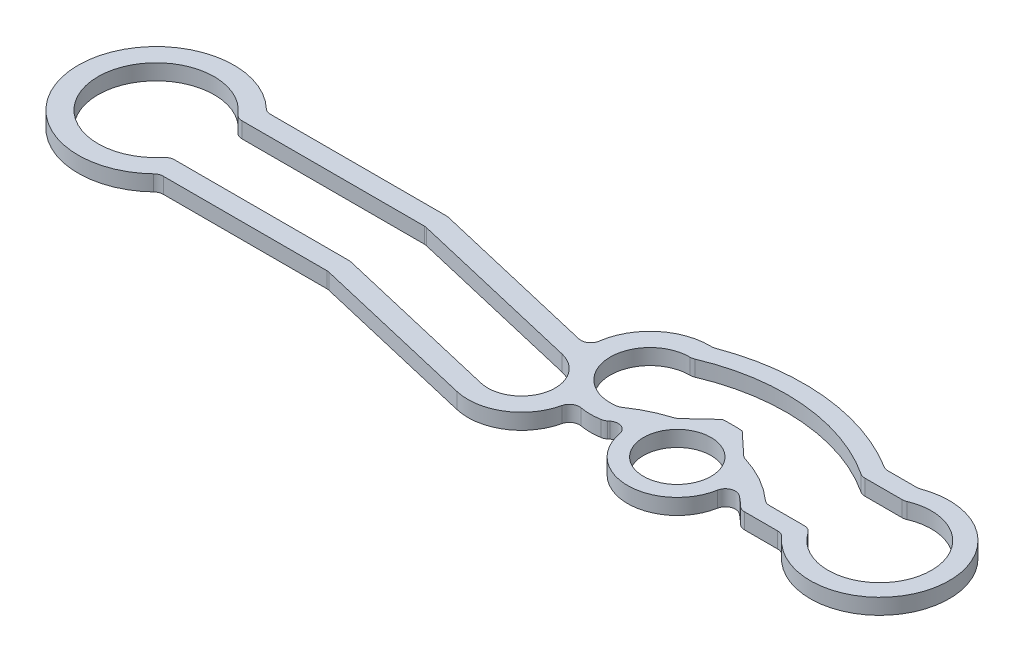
ISO-10303-21;
HEADER;
FILE_DESCRIPTION(('STEP AP214'),'2;1');
FILE_NAME('part.step','',(''),(''),'','','');
FILE_SCHEMA(('AUTOMOTIVE_DESIGN { 1 0 10303 214 1 1 1 1 }'));
ENDSEC;
DATA;
#1=APPLICATION_CONTEXT('core data for automotive mechanical design processes');
#2=APPLICATION_PROTOCOL_DEFINITION('international standard','automotive_design',2000,#1);
#3=PRODUCT_CONTEXT('',#1,'mechanical');
#4=PRODUCT('Part','Part','',(#3));
#5=PRODUCT_RELATED_PRODUCT_CATEGORY('part','',(#4));
#6=PRODUCT_DEFINITION_FORMATION('','',#4);
#7=PRODUCT_DEFINITION_CONTEXT('part definition',#1,'design');
#8=PRODUCT_DEFINITION('design','',#6,#7);
#9=PRODUCT_DEFINITION_SHAPE('','',#8);
#10=(LENGTH_UNIT() NAMED_UNIT(*) SI_UNIT(.MILLI.,.METRE.));
#11=(NAMED_UNIT(*) PLANE_ANGLE_UNIT() SI_UNIT($,.RADIAN.));
#12=(NAMED_UNIT(*) SI_UNIT($,.STERADIAN.) SOLID_ANGLE_UNIT());
#13=UNCERTAINTY_MEASURE_WITH_UNIT(LENGTH_MEASURE(1.E-05),#10,'distance_accuracy_value','');
#14=(GEOMETRIC_REPRESENTATION_CONTEXT(3) GLOBAL_UNCERTAINTY_ASSIGNED_CONTEXT((#13)) GLOBAL_UNIT_ASSIGNED_CONTEXT((#10,
#11,#12)) REPRESENTATION_CONTEXT('',''));
#15=CARTESIAN_POINT('',(0.,0.,0.));
#16=DIRECTION('',(0.,0.,1.));
#17=DIRECTION('',(1.,0.,0.));
#18=AXIS2_PLACEMENT_3D('',#15,#16,#17);
#19=CARTESIAN_POINT('',(0.,-51.41,1.7));
#20=DIRECTION('',(0.,0.,1.));
#21=DIRECTION('',(1.,0.,0.));
#22=AXIS2_PLACEMENT_3D('',#19,#20,#21);
#23=PLANE('',#22);
#24=DIRECTION('',(-1.,0.,0.));
#25=VECTOR('',#24,1.);
#26=CARTESIAN_POINT('',(0.,-52.2,1.7));
#27=LINE('',#26,#25);
#28=CARTESIAN_POINT('',(24.4118699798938,-52.2,1.7));
#29=VERTEX_POINT('',#28);
#30=CARTESIAN_POINT('',(15.6276089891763,-52.2,1.7));
#31=VERTEX_POINT('',#30);
#32=EDGE_CURVE('E593',#29,#31,#27,.T.);
#33=ORIENTED_EDGE('',*,*,#32,.T.);
#34=DIRECTION('',(0.,-1.,0.));
#35=VECTOR('',#34,1.);
#36=CARTESIAN_POINT('',(15.6276089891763,-51.41,1.7));
#37=LINE('',#36,#35);
#38=CARTESIAN_POINT('',(15.6276089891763,-51.41,1.7));
#39=VERTEX_POINT('',#38);
#40=EDGE_CURVE('E684',#31,#39,#37,.F.);
#41=ORIENTED_EDGE('',*,*,#40,.T.);
#42=DIRECTION('',(-1.,0.,0.));
#43=VECTOR('',#42,1.);
#44=CARTESIAN_POINT('',(0.,-51.41,1.7));
#45=LINE('',#44,#43);
#46=CARTESIAN_POINT('',(24.4118699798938,-51.41,1.7));
#47=VERTEX_POINT('',#46);
#48=EDGE_CURVE('E505',#47,#39,#45,.T.);
#49=ORIENTED_EDGE('',*,*,#48,.F.);
#50=DIRECTION('',(0.,-1.,0.));
#51=VECTOR('',#50,1.);
#52=CARTESIAN_POINT('',(24.4118699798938,-51.41,1.7));
#53=LINE('',#52,#51);
#54=EDGE_CURVE('E681',#47,#29,#53,.T.);
#55=ORIENTED_EDGE('',*,*,#54,.T.);
#56=EDGE_LOOP('',(#33,#41,#49,#55));
#57=FACE_BOUND('',#56,.T.);
#58=ADVANCED_FACE('F45',(#57),#23,.F.);
#59=CARTESIAN_POINT('',(13.,-51.41,0.));
#60=DIRECTION('',(0.,-1.,0.));
#61=DIRECTION('',(0.,0.,-1.));
#62=AXIS2_PLACEMENT_3D('',#59,#60,#61);
#63=CYLINDRICAL_SURFACE('',#62,2.927);
#64=CARTESIAN_POINT('',(13.,-51.41,0.));
#65=DIRECTION('',(0.,1.,0.));
#66=DIRECTION('',(0.,0.,1.));
#67=AXIS2_PLACEMENT_3D('',#64,#65,#66);
#68=CIRCLE('',#67,2.927);
#69=CARTESIAN_POINT('',(15.2442403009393,-51.41,1.87901955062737));
#70=VERTEX_POINT('',#69);
#71=CARTESIAN_POINT('',(15.2442403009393,-51.41,-1.87901955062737));
#72=VERTEX_POINT('',#71);
#73=EDGE_CURVE('E508',#70,#72,#68,.F.);
#74=ORIENTED_EDGE('',*,*,#73,.F.);
#75=DIRECTION('',(0.,-1.,0.));
#76=VECTOR('',#75,1.);
#77=CARTESIAN_POINT('',(15.2442403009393,-51.41,1.87901955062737));
#78=LINE('',#77,#76);
#79=CARTESIAN_POINT('',(15.2442403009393,-52.2,1.87901955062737));
#80=VERTEX_POINT('',#79);
#81=EDGE_CURVE('E678',#70,#80,#78,.T.);
#82=ORIENTED_EDGE('',*,*,#81,.T.);
#83=CARTESIAN_POINT('',(13.,-52.2,0.));
#84=DIRECTION('',(0.,1.,0.));
#85=DIRECTION('',(0.,0.,1.));
#86=AXIS2_PLACEMENT_3D('',#83,#84,#85);
#87=CIRCLE('',#86,2.927);
#88=CARTESIAN_POINT('',(15.2442403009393,-52.2,-1.87901955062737));
#89=VERTEX_POINT('',#88);
#90=EDGE_CURVE('E596',#80,#89,#87,.F.);
#91=ORIENTED_EDGE('',*,*,#90,.T.);
#92=DIRECTION('',(0.,-1.,0.));
#93=VECTOR('',#92,1.);
#94=CARTESIAN_POINT('',(15.2442403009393,-51.41,-1.87901955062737));
#95=LINE('',#94,#93);
#96=EDGE_CURVE('E676',#89,#72,#95,.F.);
#97=ORIENTED_EDGE('',*,*,#96,.T.);
#98=EDGE_LOOP('',(#74,#82,#91,#97));
#99=FACE_BOUND('',#98,.T.);
#100=ADVANCED_FACE('F991',(#99),#63,.F.);
#101=CARTESIAN_POINT('',(0.,-51.41,-1.7));
#102=DIRECTION('',(0.,0.,-1.));
#103=DIRECTION('',(-1.,0.,0.));
#104=AXIS2_PLACEMENT_3D('',#101,#102,#103);
#105=PLANE('',#104);
#106=DIRECTION('',(1.,0.,0.));
#107=VECTOR('',#106,1.);
#108=CARTESIAN_POINT('',(0.,-51.41,-1.7));
#109=LINE('',#108,#107);
#110=CARTESIAN_POINT('',(15.6276089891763,-51.41,-1.7));
#111=VERTEX_POINT('',#110);
#112=CARTESIAN_POINT('',(24.8056466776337,-51.41,-1.7));
#113=VERTEX_POINT('',#112);
#114=EDGE_CURVE('E511',#111,#113,#109,.T.);
#115=ORIENTED_EDGE('',*,*,#114,.F.);
#116=DIRECTION('',(0.,-1.,0.));
#117=VECTOR('',#116,1.);
#118=CARTESIAN_POINT('',(15.6276089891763,-51.41,-1.7));
#119=LINE('',#118,#117);
#120=CARTESIAN_POINT('',(15.6276089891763,-52.2,-1.7));
#121=VERTEX_POINT('',#120);
#122=EDGE_CURVE('E688',#111,#121,#119,.T.);
#123=ORIENTED_EDGE('',*,*,#122,.T.);
#124=DIRECTION('',(1.,0.,0.));
#125=VECTOR('',#124,1.);
#126=CARTESIAN_POINT('',(0.,-52.2,-1.7));
#127=LINE('',#126,#125);
#128=CARTESIAN_POINT('',(24.8056466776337,-52.2,-1.7));
#129=VERTEX_POINT('',#128);
#130=EDGE_CURVE('E599',#121,#129,#127,.T.);
#131=ORIENTED_EDGE('',*,*,#130,.T.);
#132=DIRECTION('',(0.,-1.,0.));
#133=VECTOR('',#132,1.);
#134=CARTESIAN_POINT('',(24.8056466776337,-51.41,-1.7));
#135=LINE('',#134,#133);
#136=EDGE_CURVE('E686',#129,#113,#135,.F.);
#137=ORIENTED_EDGE('',*,*,#136,.T.);
#138=EDGE_LOOP('',(#115,#123,#131,#137));
#139=FACE_BOUND('',#138,.T.);
#140=ADVANCED_FACE('F996',(#139),#105,.F.);
#141=CARTESIAN_POINT('',(1.67722743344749,-51.41,-7.14374647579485));
#142=DIRECTION('',(0.228567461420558,0.,-0.973528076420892));
#143=DIRECTION('',(-0.973528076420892,0.,-0.228567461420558));
#144=AXIS2_PLACEMENT_3D('',#141,#142,#143);
#145=PLANE('',#144);
#146=DIRECTION('',(0.973528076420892,0.,0.228567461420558));
#147=VECTOR('',#146,1.);
#148=CARTESIAN_POINT('',(1.67722743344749,-51.41,-7.14374647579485));
#149=LINE('',#148,#147);
#150=CARTESIAN_POINT('',(24.919930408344,-51.41,-1.68676403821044));
#151=VERTEX_POINT('',#150);
#152=CARTESIAN_POINT('',(33.8597422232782,-51.41,0.412148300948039));
#153=VERTEX_POINT('',#152);
#154=EDGE_CURVE('E513',#151,#153,#149,.T.);
#155=ORIENTED_EDGE('',*,*,#154,.F.);
#156=DIRECTION('',(0.,-1.,0.));
#157=VECTOR('',#156,1.);
#158=CARTESIAN_POINT('',(24.919930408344,-52.2,-1.68676403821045));
#159=LINE('',#158,#157);
#160=CARTESIAN_POINT('',(24.919930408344,-52.2,-1.68676403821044));
#161=VERTEX_POINT('',#160);
#162=EDGE_CURVE('E761',#151,#161,#159,.T.);
#163=ORIENTED_EDGE('',*,*,#162,.T.);
#164=DIRECTION('',(0.973528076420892,0.,0.228567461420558));
#165=VECTOR('',#164,1.);
#166=CARTESIAN_POINT('',(1.67722743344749,-52.2,-7.14374647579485));
#167=LINE('',#166,#165);
#168=CARTESIAN_POINT('',(33.8597422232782,-52.2,0.412148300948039));
#169=VERTEX_POINT('',#168);
#170=EDGE_CURVE('E602',#161,#169,#167,.T.);
#171=ORIENTED_EDGE('',*,*,#170,.T.);
#172=DIRECTION('',(0.,-1.,0.));
#173=VECTOR('',#172,1.);
#174=CARTESIAN_POINT('',(33.8597422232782,-51.41,0.412148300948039));
#175=LINE('',#174,#173);
#176=EDGE_CURVE('E610',#153,#169,#175,.T.);
#177=ORIENTED_EDGE('',*,*,#176,.F.);
#178=EDGE_LOOP('',(#155,#163,#171,#177));
#179=FACE_BOUND('',#178,.T.);
#180=ADVANCED_FACE('F1002',(#179),#145,.F.);
#181=CARTESIAN_POINT('',(33.4711775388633,-51.41,2.06714603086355));
#182=DIRECTION('',(0.,-1.,0.));
#183=DIRECTION('',(0.,0.,-1.));
#184=AXIS2_PLACEMENT_3D('',#181,#182,#183);
#185=CYLINDRICAL_SURFACE('',#184,1.7);
#186=CARTESIAN_POINT('',(33.4711775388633,-52.2,2.06714603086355));
#187=DIRECTION('',(0.,1.,0.));
#188=DIRECTION('',(0.,0.,1.));
#189=AXIS2_PLACEMENT_3D('',#186,#187,#188);
#190=CIRCLE('',#189,1.7);
#191=CARTESIAN_POINT('',(33.0826128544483,-52.2,3.72214376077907));
#192=VERTEX_POINT('',#191);
#193=EDGE_CURVE('E604',#169,#192,#190,.F.);
#194=ORIENTED_EDGE('',*,*,#193,.T.);
#195=DIRECTION('',(0.,-1.,0.));
#196=VECTOR('',#195,1.);
#197=CARTESIAN_POINT('',(33.0826128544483,-51.41,3.72214376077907));
#198=LINE('',#197,#196);
#199=CARTESIAN_POINT('',(33.0826128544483,-51.41,3.72214376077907));
#200=VERTEX_POINT('',#199);
#201=EDGE_CURVE('E607',#200,#192,#198,.T.);
#202=ORIENTED_EDGE('',*,*,#201,.F.);
#203=CARTESIAN_POINT('',(33.4711775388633,-51.41,2.06714603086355));
#204=DIRECTION('',(0.,1.,0.));
#205=DIRECTION('',(0.,0.,1.));
#206=AXIS2_PLACEMENT_3D('',#203,#204,#205);
#207=CIRCLE('',#206,1.7);
#208=EDGE_CURVE('E515',#153,#200,#207,.F.);
#209=ORIENTED_EDGE('',*,*,#208,.F.);
#210=ORIENTED_EDGE('',*,*,#176,.T.);
#211=EDGE_LOOP('',(#194,#202,#209,#210));
#212=FACE_BOUND('',#211,.T.);
#213=ADVANCED_FACE('F1006',(#212),#185,.F.);
#214=CARTESIAN_POINT('',(33.4711775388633,-51.41,2.06714603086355));
#215=DIRECTION('',(0.,-1.,0.));
#216=DIRECTION('',(0.,0.,-1.));
#217=AXIS2_PLACEMENT_3D('',#214,#215,#216);
#218=CYLINDRICAL_SURFACE('',#217,2.7);
#219=CARTESIAN_POINT('',(33.4711775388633,-52.2,2.06714603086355));
#220=DIRECTION('',(0.,1.,0.));
#221=DIRECTION('',(0.,0.,1.));
#222=AXIS2_PLACEMENT_3D('',#219,#220,#221);
#223=CIRCLE('',#222,2.7);
#224=CARTESIAN_POINT('',(36.1045636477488,-52.2,2.66319770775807));
#225=VERTEX_POINT('',#224);
#226=CARTESIAN_POINT('',(32.8540453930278,-52.2,4.69567183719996));
#227=VERTEX_POINT('',#226);
#228=EDGE_CURVE('E549',#225,#227,#223,.F.);
#229=ORIENTED_EDGE('',*,*,#228,.F.);
#230=DIRECTION('',(0.,-1.,0.));
#231=VECTOR('',#230,1.);
#232=CARTESIAN_POINT('',(36.1045636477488,-51.41,2.66319770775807));
#233=LINE('',#232,#231);
#234=CARTESIAN_POINT('',(36.1045636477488,-51.41,2.66319770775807));
#235=VERTEX_POINT('',#234);
#236=EDGE_CURVE('E782',#225,#235,#233,.F.);
#237=ORIENTED_EDGE('',*,*,#236,.T.);
#238=CARTESIAN_POINT('',(33.4711775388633,-51.41,2.06714603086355));
#239=DIRECTION('',(0.,1.,0.));
#240=DIRECTION('',(0.,0.,1.));
#241=AXIS2_PLACEMENT_3D('',#238,#239,#240);
#242=CIRCLE('',#241,2.7);
#243=CARTESIAN_POINT('',(32.8540453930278,-51.41,4.69567183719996));
#244=VERTEX_POINT('',#243);
#245=EDGE_CURVE('E461',#235,#244,#242,.F.);
#246=ORIENTED_EDGE('',*,*,#245,.T.);
#247=DIRECTION('',(0.,-1.,0.));
#248=VECTOR('',#247,1.);
#249=CARTESIAN_POINT('',(32.8540453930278,-51.41,4.69567183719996));
#250=LINE('',#249,#248);
#251=EDGE_CURVE('E417',#244,#227,#250,.T.);
#252=ORIENTED_EDGE('',*,*,#251,.T.);
#253=EDGE_LOOP('',(#229,#237,#246,#252));
#254=FACE_BOUND('',#253,.T.);
#255=ADVANCED_FACE('F852',(#254),#218,.T.);
#256=CARTESIAN_POINT('',(37.2037523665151,-51.41,-0.672585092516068));
#257=DIRECTION('',(0.,-1.,0.));
#258=DIRECTION('',(0.,0.,-1.));
#259=AXIS2_PLACEMENT_3D('',#256,#257,#258);
#260=CYLINDRICAL_SURFACE('',#259,2.99999999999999);
#261=CARTESIAN_POINT('',(37.2037523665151,-52.2,-0.672585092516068));
#262=DIRECTION('',(0.,1.,0.));
#263=DIRECTION('',(0.,0.,1.));
#264=AXIS2_PLACEMENT_3D('',#261,#262,#263);
#265=CIRCLE('',#264,2.99999999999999);
#266=CARTESIAN_POINT('',(36.6795884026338,-52.2,2.28126868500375));
#267=VERTEX_POINT('',#266);
#268=CARTESIAN_POINT('',(37.6932262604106,-52.2,2.28721478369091));
#269=VERTEX_POINT('',#268);
#270=EDGE_CURVE('E551',#267,#269,#265,.T.);
#271=ORIENTED_EDGE('',*,*,#270,.T.);
#272=DIRECTION('',(0.,-1.,0.));
#273=VECTOR('',#272,1.);
#274=CARTESIAN_POINT('',(37.6932262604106,-51.41,2.28721478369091));
#275=LINE('',#274,#273);
#276=CARTESIAN_POINT('',(37.6932262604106,-51.41,2.28721478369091));
#277=VERTEX_POINT('',#276);
#278=EDGE_CURVE('E644',#269,#277,#275,.F.);
#279=ORIENTED_EDGE('',*,*,#278,.T.);
#280=CARTESIAN_POINT('',(37.2037523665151,-51.41,-0.672585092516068));
#281=DIRECTION('',(0.,1.,0.));
#282=DIRECTION('',(0.,0.,1.));
#283=AXIS2_PLACEMENT_3D('',#280,#281,#282);
#284=CIRCLE('',#283,2.99999999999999);
#285=CARTESIAN_POINT('',(36.6795884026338,-51.41,2.28126868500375));
#286=VERTEX_POINT('',#285);
#287=EDGE_CURVE('E463',#286,#277,#284,.T.);
#288=ORIENTED_EDGE('',*,*,#287,.F.);
#289=DIRECTION('',(0.,-1.,0.));
#290=VECTOR('',#289,1.);
#291=CARTESIAN_POINT('',(36.6795884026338,-51.41,2.28126868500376));
#292=LINE('',#291,#290);
#293=EDGE_CURVE('E641',#286,#267,#292,.T.);
#294=ORIENTED_EDGE('',*,*,#293,.T.);
#295=EDGE_LOOP('',(#271,#279,#288,#294));
#296=FACE_BOUND('',#295,.T.);
#297=ADVANCED_FACE('F861',(#296),#260,.T.);
#298=CARTESIAN_POINT('',(41.25,-51.41,6.3108152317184));
#299=DIRECTION('',(0.,-1.,0.));
#300=DIRECTION('',(0.,0.,-1.));
#301=AXIS2_PLACEMENT_3D('',#298,#299,#300);
#302=CYLINDRICAL_SURFACE('',#301,5.3);
#303=CARTESIAN_POINT('',(41.25,-51.41,6.3108152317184));
#304=DIRECTION('',(0.,1.,0.));
#305=DIRECTION('',(0.,0.,1.));
#306=AXIS2_PLACEMENT_3D('',#303,#304,#305);
#307=CIRCLE('',#306,5.3);
#308=CARTESIAN_POINT('',(37.9252983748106,-51.41,2.18330277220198));
#309=VERTEX_POINT('',#308);
#310=CARTESIAN_POINT('',(37.9889995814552,-51.41,2.13279222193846));
#311=VERTEX_POINT('',#310);
#312=EDGE_CURVE('E466',#309,#311,#307,.F.);
#313=ORIENTED_EDGE('',*,*,#312,.F.);
#314=DIRECTION('',(0.,-1.,0.));
#315=VECTOR('',#314,1.);
#316=CARTESIAN_POINT('',(37.9252983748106,-51.41,2.18330277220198));
#317=LINE('',#316,#315);
#318=CARTESIAN_POINT('',(37.9252983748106,-52.2,2.18330277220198));
#319=VERTEX_POINT('',#318);
#320=EDGE_CURVE('E618',#309,#319,#317,.T.);
#321=ORIENTED_EDGE('',*,*,#320,.T.);
#322=CARTESIAN_POINT('',(41.25,-52.2,6.3108152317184));
#323=DIRECTION('',(0.,1.,0.));
#324=DIRECTION('',(0.,0.,1.));
#325=AXIS2_PLACEMENT_3D('',#322,#323,#324);
#326=CIRCLE('',#325,5.3);
#327=CARTESIAN_POINT('',(37.9889995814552,-52.2,2.13279222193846));
#328=VERTEX_POINT('',#327);
#329=EDGE_CURVE('E554',#319,#328,#326,.F.);
#330=ORIENTED_EDGE('',*,*,#329,.T.);
#331=DIRECTION('',(0.,-1.,0.));
#332=VECTOR('',#331,1.);
#333=CARTESIAN_POINT('',(37.9889995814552,-51.41,2.13279222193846));
#334=LINE('',#333,#332);
#335=EDGE_CURVE('E613',#328,#311,#334,.F.);
#336=ORIENTED_EDGE('',*,*,#335,.T.);
#337=EDGE_LOOP('',(#313,#321,#330,#336));
#338=FACE_BOUND('',#337,.T.);
#339=ADVANCED_FACE('F869',(#338),#302,.F.);
#340=CARTESIAN_POINT('',(41.25,-51.41,2.));
#341=DIRECTION('',(0.,-1.,0.));
#342=DIRECTION('',(0.,0.,-1.));
#343=AXIS2_PLACEMENT_3D('',#340,#341,#342);
#344=CYLINDRICAL_SURFACE('',#343,2.5);
#345=CARTESIAN_POINT('',(41.25,-52.2,2.));
#346=DIRECTION('',(0.,1.,0.));
#347=DIRECTION('',(0.,0.,1.));
#348=AXIS2_PLACEMENT_3D('',#345,#346,#347);
#349=CIRCLE('',#348,2.5);
#350=CARTESIAN_POINT('',(43.7111323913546,-52.2,2.43912111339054));
#351=VERTEX_POINT('',#350);
#352=CARTESIAN_POINT('',(38.7888676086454,-52.2,2.43912111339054));
#353=VERTEX_POINT('',#352);
#354=EDGE_CURVE('E557',#351,#353,#349,.F.);
#355=ORIENTED_EDGE('',*,*,#354,.F.);
#356=DIRECTION('',(0.,-1.,0.));
#357=VECTOR('',#356,1.);
#358=CARTESIAN_POINT('',(43.7111323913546,-51.41,2.43912111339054));
#359=LINE('',#358,#357);
#360=CARTESIAN_POINT('',(43.7111323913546,-51.41,2.43912111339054));
#361=VERTEX_POINT('',#360);
#362=EDGE_CURVE('E780',#351,#361,#359,.F.);
#363=ORIENTED_EDGE('',*,*,#362,.T.);
#364=CARTESIAN_POINT('',(41.25,-51.41,2.));
#365=DIRECTION('',(0.,1.,0.));
#366=DIRECTION('',(0.,0.,1.));
#367=AXIS2_PLACEMENT_3D('',#364,#365,#366);
#368=CIRCLE('',#367,2.5);
#369=CARTESIAN_POINT('',(38.7888676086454,-51.41,2.43912111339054));
#370=VERTEX_POINT('',#369);
#371=EDGE_CURVE('E469',#361,#370,#368,.F.);
#372=ORIENTED_EDGE('',*,*,#371,.T.);
#373=DIRECTION('',(0.,-1.,0.));
#374=VECTOR('',#373,1.);
#375=CARTESIAN_POINT('',(38.7888676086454,-51.41,2.43912111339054));
#376=LINE('',#375,#374);
#377=EDGE_CURVE('E777',#370,#353,#376,.T.);
#378=ORIENTED_EDGE('',*,*,#377,.T.);
#379=EDGE_LOOP('',(#355,#363,#372,#378));
#380=FACE_BOUND('',#379,.T.);
#381=ADVANCED_FACE('F878',(#380),#344,.T.);
#382=CARTESIAN_POINT('',(41.25,-51.41,6.3108152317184));
#383=DIRECTION('',(0.,-1.,0.));
#384=DIRECTION('',(0.,0.,-1.));
#385=AXIS2_PLACEMENT_3D('',#382,#383,#384);
#386=CYLINDRICAL_SURFACE('',#385,5.3);
#387=CARTESIAN_POINT('',(41.25,-52.2,6.3108152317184));
#388=DIRECTION('',(0.,1.,0.));
#389=DIRECTION('',(0.,0.,1.));
#390=AXIS2_PLACEMENT_3D('',#387,#388,#389);
#391=CIRCLE('',#390,5.3);
#392=CARTESIAN_POINT('',(44.5110004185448,-52.2,2.13279222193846));
#393=VERTEX_POINT('',#392);
#394=CARTESIAN_POINT('',(44.9888767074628,-52.2,2.554380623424));
#395=VERTEX_POINT('',#394);
#396=EDGE_CURVE('E560',#393,#395,#391,.F.);
#397=ORIENTED_EDGE('',*,*,#396,.T.);
#398=DIRECTION('',(0.,-1.,0.));
#399=VECTOR('',#398,1.);
#400=CARTESIAN_POINT('',(44.9888767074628,-51.41,2.554380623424));
#401=LINE('',#400,#399);
#402=CARTESIAN_POINT('',(44.9888767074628,-51.41,2.554380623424));
#403=VERTEX_POINT('',#402);
#404=EDGE_CURVE('E714',#395,#403,#401,.F.);
#405=ORIENTED_EDGE('',*,*,#404,.T.);
#406=CARTESIAN_POINT('',(41.25,-51.41,6.3108152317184));
#407=DIRECTION('',(0.,1.,0.));
#408=DIRECTION('',(0.,0.,1.));
#409=AXIS2_PLACEMENT_3D('',#406,#407,#408);
#410=CIRCLE('',#409,5.3);
#411=CARTESIAN_POINT('',(44.5110004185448,-51.41,2.13279222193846));
#412=VERTEX_POINT('',#411);
#413=EDGE_CURVE('E472',#412,#403,#410,.F.);
#414=ORIENTED_EDGE('',*,*,#413,.F.);
#415=DIRECTION('',(0.,-1.,0.));
#416=VECTOR('',#415,1.);
#417=CARTESIAN_POINT('',(44.5110004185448,-51.41,2.13279222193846));
#418=LINE('',#417,#416);
#419=EDGE_CURVE('E711',#412,#393,#418,.T.);
#420=ORIENTED_EDGE('',*,*,#419,.T.);
#421=EDGE_LOOP('',(#397,#405,#414,#420));
#422=FACE_BOUND('',#421,.T.);
#423=ADVANCED_FACE('F886',(#422),#386,.F.);
#424=CARTESIAN_POINT('',(0.,-51.41,2.7));
#425=DIRECTION('',(0.,0.,1.));
#426=DIRECTION('',(1.,0.,0.));
#427=AXIS2_PLACEMENT_3D('',#424,#425,#426);
#428=PLANE('',#427);
#429=DIRECTION('',(-1.,0.,0.));
#430=VECTOR('',#429,1.);
#431=CARTESIAN_POINT('',(0.,-51.41,2.7));
#432=LINE('',#431,#430);
#433=CARTESIAN_POINT('',(47.0037523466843,-51.41,2.7));
#434=VERTEX_POINT('',#433);
#435=CARTESIAN_POINT('',(45.341600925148,-51.41,2.7));
#436=VERTEX_POINT('',#435);
#437=EDGE_CURVE('E475',#434,#436,#432,.T.);
#438=ORIENTED_EDGE('',*,*,#437,.T.);
#439=DIRECTION('',(0.,1.,0.));
#440=VECTOR('',#439,1.);
#441=CARTESIAN_POINT('',(45.341600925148,-52.2,2.7));
#442=LINE('',#441,#440);
#443=CARTESIAN_POINT('',(45.341600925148,-52.2,2.7));
#444=VERTEX_POINT('',#443);
#445=EDGE_CURVE('E708',#436,#444,#442,.F.);
#446=ORIENTED_EDGE('',*,*,#445,.T.);
#447=DIRECTION('',(-1.,0.,0.));
#448=VECTOR('',#447,1.);
#449=CARTESIAN_POINT('',(0.,-52.2,2.7));
#450=LINE('',#449,#448);
#451=CARTESIAN_POINT('',(47.0037523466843,-52.2,2.7));
#452=VERTEX_POINT('',#451);
#453=EDGE_CURVE('E563',#452,#444,#450,.T.);
#454=ORIENTED_EDGE('',*,*,#453,.F.);
#455=DIRECTION('',(0.,1.,0.));
#456=VECTOR('',#455,1.);
#457=CARTESIAN_POINT('',(47.0037523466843,-51.41,2.7));
#458=LINE('',#457,#456);
#459=EDGE_CURVE('E706',#452,#434,#458,.T.);
#460=ORIENTED_EDGE('',*,*,#459,.T.);
#461=EDGE_LOOP('',(#438,#446,#454,#460));
#462=FACE_BOUND('',#461,.T.);
#463=ADVANCED_FACE('F895',(#462),#428,.T.);
#464=CARTESIAN_POINT('',(50.,-51.41,0.550000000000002));
#465=DIRECTION('',(0.,-1.,0.));
#466=DIRECTION('',(0.,0.,-1.));
#467=AXIS2_PLACEMENT_3D('',#464,#465,#466);
#468=CYLINDRICAL_SURFACE('',#467,3.5);
#469=CARTESIAN_POINT('',(50.,-51.41,0.550000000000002));
#470=DIRECTION('',(0.,1.,0.));
#471=DIRECTION('',(0.,0.,1.));
#472=AXIS2_PLACEMENT_3D('',#469,#470,#471);
#473=CIRCLE('',#472,3.5);
#474=CARTESIAN_POINT('',(48.7820515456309,-51.41,-2.73125));
#475=VERTEX_POINT('',#474);
#476=CARTESIAN_POINT('',(47.3782833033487,-51.41,2.86875));
#477=VERTEX_POINT('',#476);
#478=EDGE_CURVE('E478',#475,#477,#473,.F.);
#479=ORIENTED_EDGE('',*,*,#478,.T.);
#480=DIRECTION('',(0.,-1.,0.));
#481=VECTOR('',#480,1.);
#482=CARTESIAN_POINT('',(47.3782833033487,-51.41,2.86875));
#483=LINE('',#482,#481);
#484=CARTESIAN_POINT('',(47.3782833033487,-52.2,2.86875));
#485=VERTEX_POINT('',#484);
#486=EDGE_CURVE('E733',#477,#485,#483,.T.);
#487=ORIENTED_EDGE('',*,*,#486,.T.);
#488=CARTESIAN_POINT('',(50.,-52.2,0.550000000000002));
#489=DIRECTION('',(0.,1.,0.));
#490=DIRECTION('',(0.,0.,1.));
#491=AXIS2_PLACEMENT_3D('',#488,#489,#490);
#492=CIRCLE('',#491,3.5);
#493=CARTESIAN_POINT('',(48.7820515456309,-52.2,-2.73125));
#494=VERTEX_POINT('',#493);
#495=EDGE_CURVE('E566',#494,#485,#492,.F.);
#496=ORIENTED_EDGE('',*,*,#495,.F.);
#497=DIRECTION('',(0.,-1.,0.));
#498=VECTOR('',#497,1.);
#499=CARTESIAN_POINT('',(48.7820515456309,-51.41,-2.73125));
#500=LINE('',#499,#498);
#501=EDGE_CURVE('E731',#494,#475,#500,.F.);
#502=ORIENTED_EDGE('',*,*,#501,.T.);
#503=EDGE_LOOP('',(#479,#487,#496,#502));
#504=FACE_BOUND('',#503,.T.);
#505=ADVANCED_FACE('F904',(#504),#468,.T.);
#506=CARTESIAN_POINT('',(0.,-51.41,-2.7));
#507=DIRECTION('',(0.,0.,-1.));
#508=DIRECTION('',(-1.,0.,0.));
#509=AXIS2_PLACEMENT_3D('',#506,#507,#508);
#510=PLANE('',#509);
#511=DIRECTION('',(1.,0.,0.));
#512=VECTOR('',#511,1.);
#513=CARTESIAN_POINT('',(0.,-51.41,-2.7));
#514=LINE('',#513,#512);
#515=CARTESIAN_POINT('',(47.1647606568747,-51.41,-2.7));
#516=VERTEX_POINT('',#515);
#517=CARTESIAN_POINT('',(48.6080589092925,-51.41,-2.7));
#518=VERTEX_POINT('',#517);
#519=EDGE_CURVE('E481',#516,#518,#514,.T.);
#520=ORIENTED_EDGE('',*,*,#519,.T.);
#521=DIRECTION('',(0.,1.,0.));
#522=VECTOR('',#521,1.);
#523=CARTESIAN_POINT('',(48.6080589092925,-52.2,-2.7));
#524=LINE('',#523,#522);
#525=CARTESIAN_POINT('',(48.6080589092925,-52.2,-2.7));
#526=VERTEX_POINT('',#525);
#527=EDGE_CURVE('E743',#518,#526,#524,.F.);
#528=ORIENTED_EDGE('',*,*,#527,.T.);
#529=DIRECTION('',(1.,0.,0.));
#530=VECTOR('',#529,1.);
#531=CARTESIAN_POINT('',(0.,-52.2,-2.7));
#532=LINE('',#531,#530);
#533=CARTESIAN_POINT('',(47.1647606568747,-52.2,-2.7));
#534=VERTEX_POINT('',#533);
#535=EDGE_CURVE('E569',#534,#526,#532,.T.);
#536=ORIENTED_EDGE('',*,*,#535,.F.);
#537=DIRECTION('',(0.,1.,0.));
#538=VECTOR('',#537,1.);
#539=CARTESIAN_POINT('',(47.1647606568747,-51.41,-2.7));
#540=LINE('',#539,#538);
#541=EDGE_CURVE('E741',#534,#516,#540,.T.);
#542=ORIENTED_EDGE('',*,*,#541,.T.);
#543=EDGE_LOOP('',(#520,#528,#536,#542));
#544=FACE_BOUND('',#543,.T.);
#545=ADVANCED_FACE('F913',(#544),#510,.T.);
#546=CARTESIAN_POINT('',(41.25,-51.41,6.3108152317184));
#547=DIRECTION('',(0.,-1.,0.));
#548=DIRECTION('',(0.,0.,-1.));
#549=AXIS2_PLACEMENT_3D('',#546,#547,#548);
#550=CYLINDRICAL_SURFACE('',#549,10.7);
#551=CARTESIAN_POINT('',(41.25,-52.2,6.3108152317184));
#552=DIRECTION('',(0.,1.,0.));
#553=DIRECTION('',(0.,0.,1.));
#554=AXIS2_PLACEMENT_3D('',#551,#552,#553);
#555=CIRCLE('',#554,10.7);
#556=CARTESIAN_POINT('',(37.480441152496,-52.2,-3.70319625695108));
#557=VERTEX_POINT('',#556);
#558=CARTESIAN_POINT('',(46.9007088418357,-52.2,-2.77541003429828));
#559=VERTEX_POINT('',#558);
#560=EDGE_CURVE('E572',#557,#559,#555,.F.);
#561=ORIENTED_EDGE('',*,*,#560,.F.);
#562=DIRECTION('',(0.,-1.,0.));
#563=VECTOR('',#562,1.);
#564=CARTESIAN_POINT('',(37.480441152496,-51.41,-3.70319625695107));
#565=LINE('',#564,#563);
#566=CARTESIAN_POINT('',(37.480441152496,-51.41,-3.70319625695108));
#567=VERTEX_POINT('',#566);
#568=EDGE_CURVE('E704',#557,#567,#565,.F.);
#569=ORIENTED_EDGE('',*,*,#568,.T.);
#570=CARTESIAN_POINT('',(41.25,-51.41,6.3108152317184));
#571=DIRECTION('',(0.,1.,0.));
#572=DIRECTION('',(0.,0.,1.));
#573=AXIS2_PLACEMENT_3D('',#570,#571,#572);
#574=CIRCLE('',#573,10.7);
#575=CARTESIAN_POINT('',(46.9007088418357,-51.41,-2.77541003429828));
#576=VERTEX_POINT('',#575);
#577=EDGE_CURVE('E484',#567,#576,#574,.F.);
#578=ORIENTED_EDGE('',*,*,#577,.T.);
#579=DIRECTION('',(0.,-1.,0.));
#580=VECTOR('',#579,1.);
#581=CARTESIAN_POINT('',(46.9007088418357,-51.41,-2.77541003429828));
#582=LINE('',#581,#580);
#583=EDGE_CURVE('E701',#576,#559,#582,.T.);
#584=ORIENTED_EDGE('',*,*,#583,.T.);
#585=EDGE_LOOP('',(#561,#569,#578,#584));
#586=FACE_BOUND('',#585,.T.);
#587=ADVANCED_FACE('F923',(#586),#550,.T.);
#588=CARTESIAN_POINT('',(37.2037523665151,-51.41,-0.672585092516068));
#589=DIRECTION('',(0.,-1.,0.));
#590=DIRECTION('',(0.,0.,-1.));
#591=AXIS2_PLACEMENT_3D('',#588,#589,#590);
#592=CYLINDRICAL_SURFACE('',#591,2.99999999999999);
#593=CARTESIAN_POINT('',(37.2037523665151,-51.41,-0.672585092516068));
#594=DIRECTION('',(0.,1.,0.));
#595=DIRECTION('',(0.,0.,1.));
#596=AXIS2_PLACEMENT_3D('',#593,#594,#595);
#597=CIRCLE('',#596,2.99999999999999);
#598=CARTESIAN_POINT('',(37.289930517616,-51.41,-3.67134705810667));
#599=VERTEX_POINT('',#598);
#600=CARTESIAN_POINT('',(34.2326660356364,-51.41,-1.08809202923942));
#601=VERTEX_POINT('',#600);
#602=EDGE_CURVE('E487',#599,#601,#597,.T.);
#603=ORIENTED_EDGE('',*,*,#602,.F.);
#604=DIRECTION('',(0.,-1.,0.));
#605=VECTOR('',#604,1.);
#606=CARTESIAN_POINT('',(37.289930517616,-51.41,-3.67134705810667));
#607=LINE('',#606,#605);
#608=CARTESIAN_POINT('',(37.289930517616,-52.2,-3.67134705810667));
#609=VERTEX_POINT('',#608);
#610=EDGE_CURVE('E698',#599,#609,#607,.T.);
#611=ORIENTED_EDGE('',*,*,#610,.T.);
#612=CARTESIAN_POINT('',(37.2037523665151,-52.2,-0.672585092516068));
#613=DIRECTION('',(0.,1.,0.));
#614=DIRECTION('',(0.,0.,1.));
#615=AXIS2_PLACEMENT_3D('',#612,#613,#614);
#616=CIRCLE('',#615,2.99999999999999);
#617=CARTESIAN_POINT('',(34.2326660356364,-52.2,-1.08809202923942));
#618=VERTEX_POINT('',#617);
#619=EDGE_CURVE('E575',#609,#618,#616,.T.);
#620=ORIENTED_EDGE('',*,*,#619,.T.);
#621=DIRECTION('',(0.,-1.,0.));
#622=VECTOR('',#621,1.);
#623=CARTESIAN_POINT('',(34.2326660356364,-51.41,-1.08809202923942));
#624=LINE('',#623,#622);
#625=EDGE_CURVE('E696',#618,#601,#624,.F.);
#626=ORIENTED_EDGE('',*,*,#625,.T.);
#627=EDGE_LOOP('',(#603,#611,#620,#626));
#628=FACE_BOUND('',#627,.T.);
#629=ADVANCED_FACE('F931',(#628),#592,.T.);
#630=CARTESIAN_POINT('',(1.90579489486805,-51.41,-8.11727455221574));
#631=DIRECTION('',(0.228567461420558,0.,-0.973528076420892));
#632=DIRECTION('',(-0.973528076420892,0.,-0.228567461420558));
#633=AXIS2_PLACEMENT_3D('',#630,#631,#632);
#634=PLANE('',#633);
#635=DIRECTION('',(0.973528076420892,0.,0.228567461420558));
#636=VECTOR('',#635,1.);
#637=CARTESIAN_POINT('',(1.90579489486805,-52.2,-8.11727455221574));
#638=LINE('',#637,#636);
#639=CARTESIAN_POINT('',(25.0357470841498,-52.2,-2.68676403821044));
#640=VERTEX_POINT('',#639);
#641=CARTESIAN_POINT('',(33.6232012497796,-52.2,-0.670579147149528));
#642=VERTEX_POINT('',#641);
#643=EDGE_CURVE('E578',#640,#642,#638,.T.);
#644=ORIENTED_EDGE('',*,*,#643,.F.);
#645=DIRECTION('',(0.,-1.,0.));
#646=VECTOR('',#645,1.);
#647=CARTESIAN_POINT('',(25.0357470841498,-51.41,-2.68676403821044));
#648=LINE('',#647,#646);
#649=CARTESIAN_POINT('',(25.0357470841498,-51.41,-2.68676403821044));
#650=VERTEX_POINT('',#649);
#651=EDGE_CURVE('E758',#640,#650,#648,.F.);
#652=ORIENTED_EDGE('',*,*,#651,.T.);
#653=DIRECTION('',(0.973528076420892,0.,0.228567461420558));
#654=VECTOR('',#653,1.);
#655=CARTESIAN_POINT('',(1.90579489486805,-51.41,-8.11727455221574));
#656=LINE('',#655,#654);
#657=CARTESIAN_POINT('',(33.6232012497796,-51.41,-0.670579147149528));
#658=VERTEX_POINT('',#657);
#659=EDGE_CURVE('E490',#650,#658,#656,.T.);
#660=ORIENTED_EDGE('',*,*,#659,.T.);
#661=DIRECTION('',(0.,-1.,0.));
#662=VECTOR('',#661,1.);
#663=CARTESIAN_POINT('',(33.6232012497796,-51.41,-0.670579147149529));
#664=LINE('',#663,#662);
#665=EDGE_CURVE('E755',#658,#642,#664,.T.);
#666=ORIENTED_EDGE('',*,*,#665,.T.);
#667=EDGE_LOOP('',(#644,#652,#660,#666));
#668=FACE_BOUND('',#667,.T.);
#669=ADVANCED_FACE('F941',(#668),#634,.T.);
#670=CARTESIAN_POINT('',(0.,-51.41,-2.7));
#671=DIRECTION('',(0.,0.,-1.));
#672=DIRECTION('',(-1.,0.,0.));
#673=AXIS2_PLACEMENT_3D('',#670,#671,#672);
#674=PLANE('',#673);
#675=DIRECTION('',(1.,0.,0.));
#676=VECTOR('',#675,1.);
#677=CARTESIAN_POINT('',(0.,-51.41,-2.7));
#678=LINE('',#677,#676);
#679=CARTESIAN_POINT('',(16.0591386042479,-51.41,-2.7));
#680=VERTEX_POINT('',#679);
#681=CARTESIAN_POINT('',(24.9214633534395,-51.41,-2.7));
#682=VERTEX_POINT('',#681);
#683=EDGE_CURVE('E493',#680,#682,#678,.T.);
#684=ORIENTED_EDGE('',*,*,#683,.T.);
#685=DIRECTION('',(0.,-1.,0.));
#686=VECTOR('',#685,1.);
#687=CARTESIAN_POINT('',(24.9214633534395,-51.41,-2.7));
#688=LINE('',#687,#686);
#689=CARTESIAN_POINT('',(24.9214633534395,-52.2,-2.7));
#690=VERTEX_POINT('',#689);
#691=EDGE_CURVE('E752',#682,#690,#688,.T.);
#692=ORIENTED_EDGE('',*,*,#691,.T.);
#693=DIRECTION('',(1.,0.,0.));
#694=VECTOR('',#693,1.);
#695=CARTESIAN_POINT('',(0.,-52.2,-2.7));
#696=LINE('',#695,#694);
#697=CARTESIAN_POINT('',(16.0591386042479,-52.2,-2.7));
#698=VERTEX_POINT('',#697);
#699=EDGE_CURVE('E581',#698,#690,#696,.T.);
#700=ORIENTED_EDGE('',*,*,#699,.F.);
#701=DIRECTION('',(0.,1.,0.));
#702=VECTOR('',#701,1.);
#703=CARTESIAN_POINT('',(16.0591386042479,-51.41,-2.7));
#704=LINE('',#703,#702);
#705=EDGE_CURVE('E750',#698,#680,#704,.T.);
#706=ORIENTED_EDGE('',*,*,#705,.T.);
#707=EDGE_LOOP('',(#684,#692,#700,#706));
#708=FACE_BOUND('',#707,.T.);
#709=ADVANCED_FACE('F949',(#708),#674,.T.);
#710=CARTESIAN_POINT('',(13.,-51.41,0.));
#711=DIRECTION('',(0.,-1.,0.));
#712=DIRECTION('',(0.,0.,-1.));
#713=AXIS2_PLACEMENT_3D('',#710,#711,#712);
#714=CYLINDRICAL_SURFACE('',#713,3.927);
#715=CARTESIAN_POINT('',(13.,-52.2,0.));
#716=DIRECTION('',(0.,1.,0.));
#717=DIRECTION('',(0.,0.,1.));
#718=AXIS2_PLACEMENT_3D('',#715,#716,#717);
#719=CIRCLE('',#718,3.927);
#720=CARTESIAN_POINT('',(15.7136293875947,-52.2,2.83858143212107));
#721=VERTEX_POINT('',#720);
#722=CARTESIAN_POINT('',(15.7136293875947,-52.2,-2.83858143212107));
#723=VERTEX_POINT('',#722);
#724=EDGE_CURVE('E584',#721,#723,#719,.F.);
#725=ORIENTED_EDGE('',*,*,#724,.F.);
#726=DIRECTION('',(0.,-1.,0.));
#727=VECTOR('',#726,1.);
#728=CARTESIAN_POINT('',(15.7136293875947,-51.41,2.83858143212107));
#729=LINE('',#728,#727);
#730=CARTESIAN_POINT('',(15.7136293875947,-51.41,2.83858143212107));
#731=VERTEX_POINT('',#730);
#732=EDGE_CURVE('E775',#721,#731,#729,.F.);
#733=ORIENTED_EDGE('',*,*,#732,.T.);
#734=CARTESIAN_POINT('',(13.,-51.41,0.));
#735=DIRECTION('',(0.,1.,0.));
#736=DIRECTION('',(0.,0.,1.));
#737=AXIS2_PLACEMENT_3D('',#734,#735,#736);
#738=CIRCLE('',#737,3.927);
#739=CARTESIAN_POINT('',(15.7136293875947,-51.41,-2.83858143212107));
#740=VERTEX_POINT('',#739);
#741=EDGE_CURVE('E496',#731,#740,#738,.F.);
#742=ORIENTED_EDGE('',*,*,#741,.T.);
#743=DIRECTION('',(0.,-1.,0.));
#744=VECTOR('',#743,1.);
#745=CARTESIAN_POINT('',(15.7136293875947,-51.41,-2.83858143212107));
#746=LINE('',#745,#744);
#747=EDGE_CURVE('E772',#740,#723,#746,.T.);
#748=ORIENTED_EDGE('',*,*,#747,.T.);
#749=EDGE_LOOP('',(#725,#733,#742,#748));
#750=FACE_BOUND('',#749,.T.);
#751=ADVANCED_FACE('F959',(#750),#714,.T.);
#752=CARTESIAN_POINT('',(0.,-51.41,2.7));
#753=DIRECTION('',(0.,0.,1.));
#754=DIRECTION('',(1.,0.,0.));
#755=AXIS2_PLACEMENT_3D('',#752,#753,#754);
#756=PLANE('',#755);
#757=DIRECTION('',(-1.,0.,0.));
#758=VECTOR('',#757,1.);
#759=CARTESIAN_POINT('',(0.,-52.2,2.7));
#760=LINE('',#759,#758);
#761=CARTESIAN_POINT('',(24.296053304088,-52.2,2.7));
#762=VERTEX_POINT('',#761);
#763=CARTESIAN_POINT('',(16.0591386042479,-52.2,2.7));
#764=VERTEX_POINT('',#763);
#765=EDGE_CURVE('E587',#762,#764,#760,.T.);
#766=ORIENTED_EDGE('',*,*,#765,.F.);
#767=DIRECTION('',(0.,-1.,0.));
#768=VECTOR('',#767,1.);
#769=CARTESIAN_POINT('',(24.296053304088,-51.41,2.7));
#770=LINE('',#769,#768);
#771=CARTESIAN_POINT('',(24.296053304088,-51.41,2.7));
#772=VERTEX_POINT('',#771);
#773=EDGE_CURVE('E770',#762,#772,#770,.F.);
#774=ORIENTED_EDGE('',*,*,#773,.T.);
#775=DIRECTION('',(-1.,0.,0.));
#776=VECTOR('',#775,1.);
#777=CARTESIAN_POINT('',(0.,-51.41,2.7));
#778=LINE('',#777,#776);
#779=CARTESIAN_POINT('',(16.0591386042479,-51.41,2.7));
#780=VERTEX_POINT('',#779);
#781=EDGE_CURVE('E499',#772,#780,#778,.T.);
#782=ORIENTED_EDGE('',*,*,#781,.T.);
#783=DIRECTION('',(0.,1.,0.));
#784=VECTOR('',#783,1.);
#785=CARTESIAN_POINT('',(16.0591386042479,-52.2,2.7));
#786=LINE('',#785,#784);
#787=EDGE_CURVE('E767',#780,#764,#786,.F.);
#788=ORIENTED_EDGE('',*,*,#787,.T.);
#789=EDGE_LOOP('',(#766,#774,#782,#788));
#790=FACE_BOUND('',#789,.T.);
#791=ADVANCED_FACE('F968',(#790),#756,.T.);
#792=CARTESIAN_POINT('',(41.25,-51.41,6.3108152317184));
#793=DIRECTION('',(0.,-1.,0.));
#794=DIRECTION('',(0.,0.,-1.));
#795=AXIS2_PLACEMENT_3D('',#792,#793,#794);
#796=CYLINDRICAL_SURFACE('',#795,7.09999999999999);
#797=CARTESIAN_POINT('',(41.25,-52.2,6.3108152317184));
#798=DIRECTION('',(0.,1.,0.));
#799=DIRECTION('',(0.,0.,1.));
#800=AXIS2_PLACEMENT_3D('',#797,#798,#799);
#801=CIRCLE('',#800,7.09999999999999);
#802=CARTESIAN_POINT('',(40.75,-52.2,-0.771557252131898));
#803=VERTEX_POINT('',#802);
#804=CARTESIAN_POINT('',(41.75,-52.2,-0.771557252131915));
#805=VERTEX_POINT('',#804);
#806=EDGE_CURVE('E413',#803,#805,#801,.F.);
#807=ORIENTED_EDGE('',*,*,#806,.F.);
#808=DIRECTION('',(0.,-1.,0.));
#809=VECTOR('',#808,1.);
#810=CARTESIAN_POINT('',(40.75,-51.41,-0.771557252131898));
#811=LINE('',#810,#809);
#812=CARTESIAN_POINT('',(40.75,-51.41,-0.771557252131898));
#813=VERTEX_POINT('',#812);
#814=EDGE_CURVE('E406',#813,#803,#811,.T.);
#815=ORIENTED_EDGE('',*,*,#814,.F.);
#816=CARTESIAN_POINT('',(41.25,-51.41,6.3108152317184));
#817=DIRECTION('',(0.,1.,0.));
#818=DIRECTION('',(0.,0.,1.));
#819=AXIS2_PLACEMENT_3D('',#816,#817,#818);
#820=CIRCLE('',#819,7.09999999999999);
#821=CARTESIAN_POINT('',(41.75,-51.41,-0.771557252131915));
#822=VERTEX_POINT('',#821);
#823=EDGE_CURVE('E410',#813,#822,#820,.F.);
#824=ORIENTED_EDGE('',*,*,#823,.T.);
#825=DIRECTION('',(0.,-1.,0.));
#826=VECTOR('',#825,1.);
#827=CARTESIAN_POINT('',(41.75,-51.41,-0.771557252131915));
#828=LINE('',#827,#826);
#829=EDGE_CURVE('E418',#822,#805,#828,.T.);
#830=ORIENTED_EDGE('',*,*,#829,.T.);
#831=EDGE_LOOP('',(#807,#815,#824,#830));
#832=FACE_BOUND('',#831,.T.);
#833=ADVANCED_FACE('F408',(#832),#796,.T.);
#834=CARTESIAN_POINT('',(18.5864607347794,-51.41,19.9142355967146));
#835=DIRECTION('',(0.682315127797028,0.,0.731058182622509));
#836=DIRECTION('',(0.731058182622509,0.,-0.682315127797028));
#837=AXIS2_PLACEMENT_3D('',#834,#835,#836);
#838=PLANE('',#837);
#839=DIRECTION('',(-0.731058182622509,0.,0.682315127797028));
#840=VECTOR('',#839,1.);
#841=CARTESIAN_POINT('',(18.5864607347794,-52.2,19.9142355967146));
#842=LINE('',#841,#840);
#843=CARTESIAN_POINT('',(39.636325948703,-52.2,0.267862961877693));
#844=VERTEX_POINT('',#843);
#845=EDGE_CURVE('E523',#803,#844,#842,.T.);
#846=ORIENTED_EDGE('',*,*,#845,.T.);
#847=DIRECTION('',(0.,-1.,0.));
#848=VECTOR('',#847,1.);
#849=CARTESIAN_POINT('',(39.636325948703,-51.41,0.267862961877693));
#850=LINE('',#849,#848);
#851=CARTESIAN_POINT('',(39.636325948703,-51.41,0.267862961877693));
#852=VERTEX_POINT('',#851);
#853=EDGE_CURVE('E424',#844,#852,#850,.F.);
#854=ORIENTED_EDGE('',*,*,#853,.T.);
#855=DIRECTION('',(-0.731058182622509,0.,0.682315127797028));
#856=VECTOR('',#855,1.);
#857=CARTESIAN_POINT('',(18.5864607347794,-51.41,19.9142355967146));
#858=LINE('',#857,#856);
#859=EDGE_CURVE('E421',#813,#852,#858,.T.);
#860=ORIENTED_EDGE('',*,*,#859,.F.);
#861=ORIENTED_EDGE('',*,*,#814,.T.);
#862=EDGE_LOOP('',(#846,#854,#860,#861));
#863=FACE_BOUND('',#862,.T.);
#864=ADVANCED_FACE('F422',(#863),#838,.F.);
#865=CARTESIAN_POINT('',(41.25,-51.41,6.3108152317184));
#866=DIRECTION('',(0.,-1.,0.));
#867=DIRECTION('',(0.,0.,-1.));
#868=AXIS2_PLACEMENT_3D('',#865,#866,#867);
#869=CYLINDRICAL_SURFACE('',#868,6.2);
#870=CARTESIAN_POINT('',(41.25,-52.2,6.3108152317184));
#871=DIRECTION('',(0.,1.,0.));
#872=DIRECTION('',(0.,0.,1.));
#873=AXIS2_PLACEMENT_3D('',#870,#871,#872);
#874=CIRCLE('',#873,6.2);
#875=CARTESIAN_POINT('',(37.7086797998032,-52.2,1.22170418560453));
#876=VERTEX_POINT('',#875);
#877=CARTESIAN_POINT('',(39.4410513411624,-52.2,0.380578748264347));
#878=VERTEX_POINT('',#877);
#879=EDGE_CURVE('E525',#876,#878,#874,.F.);
#880=ORIENTED_EDGE('',*,*,#879,.F.);
#881=DIRECTION('',(0.,-1.,0.));
#882=VECTOR('',#881,1.);
#883=CARTESIAN_POINT('',(37.7086797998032,-51.41,1.22170418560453));
#884=LINE('',#883,#882);
#885=CARTESIAN_POINT('',(37.7086797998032,-51.41,1.22170418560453));
#886=VERTEX_POINT('',#885);
#887=EDGE_CURVE('E674',#876,#886,#884,.F.);
#888=ORIENTED_EDGE('',*,*,#887,.T.);
#889=CARTESIAN_POINT('',(41.25,-51.41,6.3108152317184));
#890=DIRECTION('',(0.,1.,0.));
#891=DIRECTION('',(0.,0.,1.));
#892=AXIS2_PLACEMENT_3D('',#889,#890,#891);
#893=CIRCLE('',#892,6.2);
#894=CARTESIAN_POINT('',(39.4410513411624,-51.41,0.380578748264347));
#895=VERTEX_POINT('',#894);
#896=EDGE_CURVE('E427',#886,#895,#893,.F.);
#897=ORIENTED_EDGE('',*,*,#896,.T.);
#898=DIRECTION('',(0.,-1.,0.));
#899=VECTOR('',#898,1.);
#900=CARTESIAN_POINT('',(39.4410513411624,-51.41,0.380578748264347));
#901=LINE('',#900,#899);
#902=EDGE_CURVE('E671',#895,#878,#901,.T.);
#903=ORIENTED_EDGE('',*,*,#902,.T.);
#904=EDGE_LOOP('',(#880,#888,#897,#903));
#905=FACE_BOUND('',#904,.T.);
#906=ADVANCED_FACE('F1332',(#905),#869,.T.);
#907=CARTESIAN_POINT('',(37.2037523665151,-51.41,-0.672585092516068));
#908=DIRECTION('',(0.,-1.,0.));
#909=DIRECTION('',(0.,0.,-1.));
#910=AXIS2_PLACEMENT_3D('',#907,#908,#909);
#911=CYLINDRICAL_SURFACE('',#910,1.99999999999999);
#912=CARTESIAN_POINT('',(37.2037523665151,-51.41,-0.672585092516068));
#913=DIRECTION('',(0.,1.,0.));
#914=DIRECTION('',(0.,0.,1.));
#915=AXIS2_PLACEMENT_3D('',#912,#913,#914);
#916=CIRCLE('',#915,1.99999999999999);
#917=CARTESIAN_POINT('',(37.2250095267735,-51.41,-2.67247212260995));
#918=VERTEX_POINT('',#917);
#919=CARTESIAN_POINT('',(37.4962018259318,-51.41,1.30591770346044));
#920=VERTEX_POINT('',#919);
#921=EDGE_CURVE('E442',#918,#920,#916,.T.);
#922=ORIENTED_EDGE('',*,*,#921,.T.);
#923=DIRECTION('',(0.,-1.,0.));
#924=VECTOR('',#923,1.);
#925=CARTESIAN_POINT('',(37.4962018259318,-51.41,1.30591770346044));
#926=LINE('',#925,#924);
#927=CARTESIAN_POINT('',(37.4962018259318,-52.2,1.30591770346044));
#928=VERTEX_POINT('',#927);
#929=EDGE_CURVE('E668',#920,#928,#926,.T.);
#930=ORIENTED_EDGE('',*,*,#929,.T.);
#931=CARTESIAN_POINT('',(37.2037523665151,-52.2,-0.672585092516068));
#932=DIRECTION('',(0.,1.,0.));
#933=DIRECTION('',(0.,0.,1.));
#934=AXIS2_PLACEMENT_3D('',#931,#932,#933);
#935=CIRCLE('',#934,1.99999999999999);
#936=CARTESIAN_POINT('',(37.2250095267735,-52.2,-2.67247212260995));
#937=VERTEX_POINT('',#936);
#938=EDGE_CURVE('E528',#937,#928,#935,.T.);
#939=ORIENTED_EDGE('',*,*,#938,.F.);
#940=DIRECTION('',(0.,-1.,0.));
#941=VECTOR('',#940,1.);
#942=CARTESIAN_POINT('',(37.2250095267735,-51.41,-2.67247212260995));
#943=LINE('',#942,#941);
#944=EDGE_CURVE('E666',#937,#918,#943,.F.);
#945=ORIENTED_EDGE('',*,*,#944,.T.);
#946=EDGE_LOOP('',(#922,#930,#939,#945));
#947=FACE_BOUND('',#946,.T.);
#948=ADVANCED_FACE('F1323',(#947),#911,.F.);
#949=CARTESIAN_POINT('',(41.25,-51.41,6.3108152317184));
#950=DIRECTION('',(0.,-1.,0.));
#951=DIRECTION('',(0.,0.,-1.));
#952=AXIS2_PLACEMENT_3D('',#949,#950,#951);
#953=CYLINDRICAL_SURFACE('',#952,9.8);
#954=CARTESIAN_POINT('',(41.25,-51.41,6.3108152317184));
#955=DIRECTION('',(0.,1.,0.));
#956=DIRECTION('',(0.,0.,1.));
#957=AXIS2_PLACEMENT_3D('',#954,#955,#956);
#958=CIRCLE('',#957,9.8);
#959=CARTESIAN_POINT('',(37.425453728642,-51.41,-2.71209149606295));
#960=VERTEX_POINT('',#959);
#961=CARTESIAN_POINT('',(46.6275264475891,-51.41,-1.88199926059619));
#962=VERTEX_POINT('',#961);
#963=EDGE_CURVE('E445',#960,#962,#958,.F.);
#964=ORIENTED_EDGE('',*,*,#963,.F.);
#965=DIRECTION('',(0.,-1.,0.));
#966=VECTOR('',#965,1.);
#967=CARTESIAN_POINT('',(37.425453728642,-51.41,-2.71209149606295));
#968=LINE('',#967,#966);
#969=CARTESIAN_POINT('',(37.425453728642,-52.2,-2.71209149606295));
#970=VERTEX_POINT('',#969);
#971=EDGE_CURVE('E693',#960,#970,#968,.T.);
#972=ORIENTED_EDGE('',*,*,#971,.T.);
#973=CARTESIAN_POINT('',(41.25,-52.2,6.3108152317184));
#974=DIRECTION('',(0.,1.,0.));
#975=DIRECTION('',(0.,0.,1.));
#976=AXIS2_PLACEMENT_3D('',#973,#974,#975);
#977=CIRCLE('',#976,9.8);
#978=CARTESIAN_POINT('',(46.6275264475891,-52.2,-1.88199926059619));
#979=VERTEX_POINT('',#978);
#980=EDGE_CURVE('E531',#970,#979,#977,.F.);
#981=ORIENTED_EDGE('',*,*,#980,.T.);
#982=DIRECTION('',(0.,-1.,0.));
#983=VECTOR('',#982,1.);
#984=CARTESIAN_POINT('',(46.6275264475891,-51.41,-1.88199926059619));
#985=LINE('',#984,#983);
#986=EDGE_CURVE('E691',#979,#962,#985,.F.);
#987=ORIENTED_EDGE('',*,*,#986,.T.);
#988=EDGE_LOOP('',(#964,#972,#981,#987));
#989=FACE_BOUND('',#988,.T.);
#990=ADVANCED_FACE('F1314',(#989),#953,.F.);
#991=CARTESIAN_POINT('',(0.,-51.41,-1.8));
#992=DIRECTION('',(0.,0.,-1.));
#993=DIRECTION('',(-1.,0.,0.));
#994=AXIS2_PLACEMENT_3D('',#991,#992,#993);
#995=PLANE('',#994);
#996=DIRECTION('',(1.,0.,0.));
#997=VECTOR('',#996,1.);
#998=CARTESIAN_POINT('',(0.,-52.2,-1.8));
#999=LINE('',#998,#997);
#1000=CARTESIAN_POINT('',(46.9018900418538,-52.2,-1.8));
#1001=VERTEX_POINT('',#1000);
#1002=CARTESIAN_POINT('',(48.780368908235,-52.2,-1.8));
#1003=VERTEX_POINT('',#1002);
#1004=EDGE_CURVE('E534',#1001,#1003,#999,.T.);
#1005=ORIENTED_EDGE('',*,*,#1004,.T.);
#1006=DIRECTION('',(0.,-1.,0.));
#1007=VECTOR('',#1006,1.);
#1008=CARTESIAN_POINT('',(48.780368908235,-51.41,-1.8));
#1009=LINE('',#1008,#1007);
#1010=CARTESIAN_POINT('',(48.780368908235,-51.41,-1.8));
#1011=VERTEX_POINT('',#1010);
#1012=EDGE_CURVE('E739',#1003,#1011,#1009,.F.);
#1013=ORIENTED_EDGE('',*,*,#1012,.T.);
#1014=DIRECTION('',(1.,0.,0.));
#1015=VECTOR('',#1014,1.);
#1016=CARTESIAN_POINT('',(0.,-51.41,-1.8));
#1017=LINE('',#1016,#1015);
#1018=CARTESIAN_POINT('',(46.9018900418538,-51.41,-1.8));
#1019=VERTEX_POINT('',#1018);
#1020=EDGE_CURVE('E448',#1019,#1011,#1017,.T.);
#1021=ORIENTED_EDGE('',*,*,#1020,.F.);
#1022=DIRECTION('',(0.,-1.,0.));
#1023=VECTOR('',#1022,1.);
#1024=CARTESIAN_POINT('',(46.9018900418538,-51.41,-1.8));
#1025=LINE('',#1024,#1023);
#1026=EDGE_CURVE('E736',#1019,#1001,#1025,.T.);
#1027=ORIENTED_EDGE('',*,*,#1026,.T.);
#1028=EDGE_LOOP('',(#1005,#1013,#1021,#1027));
#1029=FACE_BOUND('',#1028,.T.);
#1030=ADVANCED_FACE('F1305',(#1029),#995,.F.);
#1031=CARTESIAN_POINT('',(50.,-51.41,0.550000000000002));
#1032=DIRECTION('',(0.,-1.,0.));
#1033=DIRECTION('',(0.,0.,-1.));
#1034=AXIS2_PLACEMENT_3D('',#1031,#1032,#1033);
#1035=CYLINDRICAL_SURFACE('',#1034,2.6);
#1036=CARTESIAN_POINT('',(50.,-52.2,0.550000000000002));
#1037=DIRECTION('',(0.,1.,0.));
#1038=DIRECTION('',(0.,0.,1.));
#1039=AXIS2_PLACEMENT_3D('',#1036,#1037,#1038);
#1040=CIRCLE('',#1039,2.6);
#1041=CARTESIAN_POINT('',(48.9770836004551,-52.2,-1.84032258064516));
#1042=VERTEX_POINT('',#1041);
#1043=CARTESIAN_POINT('',(47.853902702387,-52.2,2.01774193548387));
#1044=VERTEX_POINT('',#1043);
#1045=EDGE_CURVE('E537',#1042,#1044,#1040,.F.);
#1046=ORIENTED_EDGE('',*,*,#1045,.T.);
#1047=DIRECTION('',(0.,-1.,0.));
#1048=VECTOR('',#1047,1.);
#1049=CARTESIAN_POINT('',(47.853902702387,-51.41,2.01774193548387));
#1050=LINE('',#1049,#1048);
#1051=CARTESIAN_POINT('',(47.853902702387,-51.41,2.01774193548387));
#1052=VERTEX_POINT('',#1051);
#1053=EDGE_CURVE('E729',#1044,#1052,#1050,.F.);
#1054=ORIENTED_EDGE('',*,*,#1053,.T.);
#1055=CARTESIAN_POINT('',(50.,-51.41,0.550000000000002));
#1056=DIRECTION('',(0.,1.,0.));
#1057=DIRECTION('',(0.,0.,1.));
#1058=AXIS2_PLACEMENT_3D('',#1055,#1056,#1057);
#1059=CIRCLE('',#1058,2.6);
#1060=CARTESIAN_POINT('',(48.9770836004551,-51.41,-1.84032258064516));
#1061=VERTEX_POINT('',#1060);
#1062=EDGE_CURVE('E451',#1061,#1052,#1059,.F.);
#1063=ORIENTED_EDGE('',*,*,#1062,.F.);
#1064=DIRECTION('',(0.,-1.,0.));
#1065=VECTOR('',#1064,1.);
#1066=CARTESIAN_POINT('',(48.9770836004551,-51.41,-1.84032258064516));
#1067=LINE('',#1066,#1065);
#1068=EDGE_CURVE('E726',#1061,#1042,#1067,.T.);
#1069=ORIENTED_EDGE('',*,*,#1068,.T.);
#1070=EDGE_LOOP('',(#1046,#1054,#1063,#1069));
#1071=FACE_BOUND('',#1070,.T.);
#1072=ADVANCED_FACE('F1296',(#1071),#1035,.F.);
#1073=CARTESIAN_POINT('',(0.,-51.41,1.80000000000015));
#1074=DIRECTION('',(0.,0.,1.));
#1075=DIRECTION('',(1.,0.,0.));
#1076=AXIS2_PLACEMENT_3D('',#1073,#1074,#1075);
#1077=PLANE('',#1076);
#1078=DIRECTION('',(-1.,0.,0.));
#1079=VECTOR('',#1078,1.);
#1080=CARTESIAN_POINT('',(0.,-52.2,1.80000000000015));
#1081=LINE('',#1080,#1079);
#1082=CARTESIAN_POINT('',(47.4411916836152,-52.2,1.8));
#1083=VERTEX_POINT('',#1082);
#1084=CARTESIAN_POINT('',(45.6976657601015,-52.2,1.8));
#1085=VERTEX_POINT('',#1084);
#1086=EDGE_CURVE('E540',#1083,#1085,#1081,.T.);
#1087=ORIENTED_EDGE('',*,*,#1086,.T.);
#1088=DIRECTION('',(0.,-1.,0.));
#1089=VECTOR('',#1088,1.);
#1090=CARTESIAN_POINT('',(45.6976657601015,-51.41,1.8));
#1091=LINE('',#1090,#1089);
#1092=CARTESIAN_POINT('',(45.6976657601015,-51.41,1.8));
#1093=VERTEX_POINT('',#1092);
#1094=EDGE_CURVE('E724',#1085,#1093,#1091,.F.);
#1095=ORIENTED_EDGE('',*,*,#1094,.T.);
#1096=DIRECTION('',(-1.,0.,0.));
#1097=VECTOR('',#1096,1.);
#1098=CARTESIAN_POINT('',(0.,-51.41,1.80000000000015));
#1099=LINE('',#1098,#1097);
#1100=CARTESIAN_POINT('',(47.4411916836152,-51.41,1.8));
#1101=VERTEX_POINT('',#1100);
#1102=EDGE_CURVE('E454',#1101,#1093,#1099,.T.);
#1103=ORIENTED_EDGE('',*,*,#1102,.F.);
#1104=DIRECTION('',(0.,-1.,0.));
#1105=VECTOR('',#1104,1.);
#1106=CARTESIAN_POINT('',(47.4411916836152,-51.41,1.8));
#1107=LINE('',#1106,#1105);
#1108=EDGE_CURVE('E721',#1101,#1083,#1107,.T.);
#1109=ORIENTED_EDGE('',*,*,#1108,.T.);
#1110=EDGE_LOOP('',(#1087,#1095,#1103,#1109));
#1111=FACE_BOUND('',#1110,.T.);
#1112=ADVANCED_FACE('F1287',(#1111),#1077,.F.);
#1113=CARTESIAN_POINT('',(41.25,-51.41,6.3108152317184));
#1114=DIRECTION('',(0.,-1.,0.));
#1115=DIRECTION('',(0.,0.,-1.));
#1116=AXIS2_PLACEMENT_3D('',#1113,#1114,#1115);
#1117=CYLINDRICAL_SURFACE('',#1116,6.2);
#1118=CARTESIAN_POINT('',(41.25,-51.41,6.3108152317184));
#1119=DIRECTION('',(0.,1.,0.));
#1120=DIRECTION('',(0.,0.,1.));
#1121=AXIS2_PLACEMENT_3D('',#1118,#1119,#1120);
#1122=CIRCLE('',#1121,6.2);
#1123=CARTESIAN_POINT('',(43.0589486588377,-51.41,0.380578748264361));
#1124=VERTEX_POINT('',#1123);
#1125=CARTESIAN_POINT('',(45.36575040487,-51.41,1.67394143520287));
#1126=VERTEX_POINT('',#1125);
#1127=EDGE_CURVE('E457',#1124,#1126,#1122,.F.);
#1128=ORIENTED_EDGE('',*,*,#1127,.T.);
#1129=DIRECTION('',(0.,-1.,0.));
#1130=VECTOR('',#1129,1.);
#1131=CARTESIAN_POINT('',(45.36575040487,-51.41,1.67394143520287));
#1132=LINE('',#1131,#1130);
#1133=CARTESIAN_POINT('',(45.36575040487,-52.2,1.67394143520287));
#1134=VERTEX_POINT('',#1133);
#1135=EDGE_CURVE('E718',#1126,#1134,#1132,.T.);
#1136=ORIENTED_EDGE('',*,*,#1135,.T.);
#1137=CARTESIAN_POINT('',(41.25,-52.2,6.3108152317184));
#1138=DIRECTION('',(0.,1.,0.));
#1139=DIRECTION('',(0.,0.,1.));
#1140=AXIS2_PLACEMENT_3D('',#1137,#1138,#1139);
#1141=CIRCLE('',#1140,6.2);
#1142=CARTESIAN_POINT('',(43.0589486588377,-52.2,0.380578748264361));
#1143=VERTEX_POINT('',#1142);
#1144=EDGE_CURVE('E543',#1143,#1134,#1141,.F.);
#1145=ORIENTED_EDGE('',*,*,#1144,.F.);
#1146=DIRECTION('',(0.,-1.,0.));
#1147=VECTOR('',#1146,1.);
#1148=CARTESIAN_POINT('',(43.0589486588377,-51.41,0.380578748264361));
#1149=LINE('',#1148,#1147);
#1150=EDGE_CURVE('E716',#1143,#1124,#1149,.F.);
#1151=ORIENTED_EDGE('',*,*,#1150,.T.);
#1152=EDGE_LOOP('',(#1128,#1136,#1145,#1151));
#1153=FACE_BOUND('',#1152,.T.);
#1154=ADVANCED_FACE('F986',(#1153),#1117,.T.);
#1155=CARTESIAN_POINT('',(0.900098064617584,-51.41,-3.83375101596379));
#1156=DIRECTION('',(-0.228567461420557,0.,0.973528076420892));
#1157=DIRECTION('',(0.973528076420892,0.,0.228567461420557));
#1158=AXIS2_PLACEMENT_3D('',#1155,#1156,#1157);
#1159=PLANE('',#1158);
#1160=DIRECTION('',(-0.973528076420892,0.,-0.228567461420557));
#1161=VECTOR('',#1160,1.);
#1162=CARTESIAN_POINT('',(0.900098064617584,-52.2,-3.83375101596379));
#1163=LINE('',#1162,#1161);
#1164=CARTESIAN_POINT('',(24.5261537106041,-52.2,1.71323596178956));
#1165=VERTEX_POINT('',#1164);
#1166=EDGE_CURVE('E437',#192,#1165,#1163,.T.);
#1167=ORIENTED_EDGE('',*,*,#1166,.T.);
#1168=DIRECTION('',(0.,-1.,0.));
#1169=VECTOR('',#1168,1.);
#1170=CARTESIAN_POINT('',(24.5261537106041,-51.41,1.71323596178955));
#1171=LINE('',#1170,#1169);
#1172=CARTESIAN_POINT('',(24.5261537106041,-51.41,1.71323596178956));
#1173=VERTEX_POINT('',#1172);
#1174=EDGE_CURVE('E60',#1165,#1173,#1171,.F.);
#1175=ORIENTED_EDGE('',*,*,#1174,.T.);
#1176=DIRECTION('',(-0.973528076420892,0.,-0.228567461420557));
#1177=VECTOR('',#1176,1.);
#1178=CARTESIAN_POINT('',(0.900098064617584,-51.41,-3.83375101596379));
#1179=LINE('',#1178,#1177);
#1180=EDGE_CURVE('E517',#200,#1173,#1179,.T.);
#1181=ORIENTED_EDGE('',*,*,#1180,.F.);
#1182=ORIENTED_EDGE('',*,*,#201,.T.);
#1183=EDGE_LOOP('',(#1167,#1175,#1181,#1182));
#1184=FACE_BOUND('',#1183,.T.);
#1185=ADVANCED_FACE('F977',(#1184),#1159,.F.);
#1186=CARTESIAN_POINT('',(0.671530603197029,-51.41,-2.8602229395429));
#1187=DIRECTION('',(-0.228567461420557,0.,0.973528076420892));
#1188=DIRECTION('',(0.973528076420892,0.,0.228567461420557));
#1189=AXIS2_PLACEMENT_3D('',#1186,#1187,#1188);
#1190=PLANE('',#1189);
#1191=DIRECTION('',(-0.973528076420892,0.,-0.228567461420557));
#1192=VECTOR('',#1191,1.);
#1193=CARTESIAN_POINT('',(0.671530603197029,-51.41,-2.8602229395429));
#1194=LINE('',#1193,#1192);
#1195=CARTESIAN_POINT('',(24.4103370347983,-51.41,2.71323596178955));
#1196=VERTEX_POINT('',#1195);
#1197=EDGE_CURVE('E502',#244,#1196,#1194,.T.);
#1198=ORIENTED_EDGE('',*,*,#1197,.T.);
#1199=DIRECTION('',(0.,-1.,0.));
#1200=VECTOR('',#1199,1.);
#1201=CARTESIAN_POINT('',(24.4103370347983,-52.2,2.71323596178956));
#1202=LINE('',#1201,#1200);
#1203=CARTESIAN_POINT('',(24.4103370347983,-52.2,2.71323596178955));
#1204=VERTEX_POINT('',#1203);
#1205=EDGE_CURVE('E764',#1196,#1204,#1202,.T.);
#1206=ORIENTED_EDGE('',*,*,#1205,.T.);
#1207=DIRECTION('',(-0.973528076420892,0.,-0.228567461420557));
#1208=VECTOR('',#1207,1.);
#1209=CARTESIAN_POINT('',(0.671530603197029,-52.2,-2.8602229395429));
#1210=LINE('',#1209,#1208);
#1211=EDGE_CURVE('E590',#227,#1204,#1210,.T.);
#1212=ORIENTED_EDGE('',*,*,#1211,.F.);
#1213=ORIENTED_EDGE('',*,*,#251,.F.);
#1214=EDGE_LOOP('',(#1198,#1206,#1212,#1213));
#1215=FACE_BOUND('',#1214,.T.);
#1216=ADVANCED_FACE('F974',(#1215),#1190,.T.);
#1217=CARTESIAN_POINT('',(19.8217387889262,-51.41,-21.2377591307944));
#1218=DIRECTION('',(0.682315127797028,0.,-0.731058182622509));
#1219=DIRECTION('',(-0.731058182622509,0.,-0.682315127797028));
#1220=AXIS2_PLACEMENT_3D('',#1217,#1218,#1219);
#1221=PLANE('',#1220);
#1222=DIRECTION('',(0.731058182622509,0.,0.682315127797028));
#1223=VECTOR('',#1222,1.);
#1224=CARTESIAN_POINT('',(19.8217387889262,-51.41,-21.2377591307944));
#1225=LINE('',#1224,#1223);
#1226=CARTESIAN_POINT('',(42.863674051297,-51.41,0.26786296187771));
#1227=VERTEX_POINT('',#1226);
#1228=EDGE_CURVE('E433',#822,#1227,#1225,.T.);
#1229=ORIENTED_EDGE('',*,*,#1228,.T.);
#1230=DIRECTION('',(0.,1.,0.));
#1231=VECTOR('',#1230,1.);
#1232=CARTESIAN_POINT('',(42.863674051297,-52.2,0.26786296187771));
#1233=LINE('',#1232,#1231);
#1234=CARTESIAN_POINT('',(42.863674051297,-52.2,0.26786296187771));
#1235=VERTEX_POINT('',#1234);
#1236=EDGE_CURVE('E747',#1227,#1235,#1233,.F.);
#1237=ORIENTED_EDGE('',*,*,#1236,.T.);
#1238=DIRECTION('',(0.731058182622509,0.,0.682315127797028));
#1239=VECTOR('',#1238,1.);
#1240=CARTESIAN_POINT('',(19.8217387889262,-52.2,-21.2377591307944));
#1241=LINE('',#1240,#1239);
#1242=EDGE_CURVE('E546',#805,#1235,#1241,.T.);
#1243=ORIENTED_EDGE('',*,*,#1242,.F.);
#1244=ORIENTED_EDGE('',*,*,#829,.F.);
#1245=EDGE_LOOP('',(#1229,#1237,#1243,#1244));
#1246=FACE_BOUND('',#1245,.T.);
#1247=ADVANCED_FACE('F976',(#1246),#1221,.T.);
#1248=CARTESIAN_POINT('',(41.25,-51.41,2.));
#1249=DIRECTION('',(0.,-1.,0.));
#1250=DIRECTION('',(0.,0.,-1.));
#1251=AXIS2_PLACEMENT_3D('',#1248,#1249,#1250);
#1252=CYLINDRICAL_SURFACE('',#1251,1.7);
#1253=CARTESIAN_POINT('',(41.25,-51.41,2.));
#1254=DIRECTION('',(0.,1.,0.));
#1255=DIRECTION('',(0.,0.,1.));
#1256=AXIS2_PLACEMENT_3D('',#1253,#1254,#1255);
#1257=CIRCLE('',#1256,1.7);
#1258=CARTESIAN_POINT('',(41.25,-51.41,0.300000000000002));
#1259=VERTEX_POINT('',#1258);
#1260=EDGE_CURVE('E519',#1259,#1259,#1257,.F.);
#1261=CARTESIAN_POINT('',(41.25,-52.2,2.));
#1262=DIRECTION('',(0.,1.,0.));
#1263=DIRECTION('',(0.,0.,1.));
#1264=AXIS2_PLACEMENT_3D('',#1261,#1262,#1263);
#1265=CIRCLE('',#1264,1.7);
#1266=CARTESIAN_POINT('',(41.25,-52.2,0.300000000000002));
#1267=VERTEX_POINT('',#1266);
#1268=EDGE_CURVE('E434',#1267,#1267,#1265,.F.);
#1269=CARTESIAN_POINT('',(41.25,-51.41,0.300000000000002));
#1270=CARTESIAN_POINT('',(41.25,-51.4182291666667,0.300000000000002));
#1271=CARTESIAN_POINT('',(41.25,-51.4264583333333,0.300000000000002));
#1272=CARTESIAN_POINT('',(41.25,-51.4429166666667,0.300000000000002));
#1273=CARTESIAN_POINT('',(41.25,-51.4511458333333,0.300000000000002));
#1274=CARTESIAN_POINT('',(41.25,-51.4676041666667,0.300000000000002));
#1275=CARTESIAN_POINT('',(41.25,-51.4758333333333,0.300000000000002));
#1276=CARTESIAN_POINT('',(41.25,-51.4922916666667,0.300000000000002));
#1277=CARTESIAN_POINT('',(41.25,-51.5005208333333,0.300000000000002));
#1278=CARTESIAN_POINT('',(41.25,-51.5169791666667,0.300000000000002));
#1279=CARTESIAN_POINT('',(41.25,-51.5252083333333,0.300000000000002));
#1280=CARTESIAN_POINT('',(41.25,-51.5416666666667,0.300000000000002));
#1281=CARTESIAN_POINT('',(41.25,-51.5498958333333,0.300000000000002));
#1282=CARTESIAN_POINT('',(41.25,-51.5663541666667,0.300000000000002));
#1283=CARTESIAN_POINT('',(41.25,-51.5745833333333,0.300000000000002));
#1284=CARTESIAN_POINT('',(41.25,-51.5910416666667,0.300000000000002));
#1285=CARTESIAN_POINT('',(41.25,-51.5992708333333,0.300000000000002));
#1286=CARTESIAN_POINT('',(41.25,-51.6157291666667,0.300000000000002));
#1287=CARTESIAN_POINT('',(41.25,-51.6239583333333,0.300000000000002));
#1288=CARTESIAN_POINT('',(41.25,-51.6404166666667,0.300000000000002));
#1289=CARTESIAN_POINT('',(41.25,-51.6486458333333,0.300000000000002));
#1290=CARTESIAN_POINT('',(41.25,-51.6651041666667,0.300000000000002));
#1291=CARTESIAN_POINT('',(41.25,-51.6733333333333,0.300000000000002));
#1292=CARTESIAN_POINT('',(41.25,-51.6897916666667,0.300000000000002));
#1293=CARTESIAN_POINT('',(41.25,-51.6980208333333,0.300000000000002));
#1294=CARTESIAN_POINT('',(41.25,-51.7144791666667,0.300000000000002));
#1295=CARTESIAN_POINT('',(41.25,-51.7227083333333,0.300000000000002));
#1296=CARTESIAN_POINT('',(41.25,-51.7391666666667,0.300000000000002));
#1297=CARTESIAN_POINT('',(41.25,-51.7473958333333,0.300000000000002));
#1298=CARTESIAN_POINT('',(41.25,-51.7638541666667,0.300000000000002));
#1299=CARTESIAN_POINT('',(41.25,-51.7720833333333,0.300000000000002));
#1300=CARTESIAN_POINT('',(41.25,-51.7885416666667,0.300000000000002));
#1301=CARTESIAN_POINT('',(41.25,-51.7967708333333,0.300000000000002));
#1302=CARTESIAN_POINT('',(41.25,-51.8132291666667,0.300000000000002));
#1303=CARTESIAN_POINT('',(41.25,-51.8214583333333,0.300000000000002));
#1304=CARTESIAN_POINT('',(41.25,-51.8379166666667,0.300000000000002));
#1305=CARTESIAN_POINT('',(41.25,-51.8461458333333,0.300000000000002));
#1306=CARTESIAN_POINT('',(41.25,-51.8626041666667,0.300000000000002));
#1307=CARTESIAN_POINT('',(41.25,-51.8708333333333,0.300000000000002));
#1308=CARTESIAN_POINT('',(41.25,-51.8872916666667,0.300000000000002));
#1309=CARTESIAN_POINT('',(41.25,-51.8955208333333,0.300000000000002));
#1310=CARTESIAN_POINT('',(41.25,-51.9119791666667,0.300000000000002));
#1311=CARTESIAN_POINT('',(41.25,-51.9202083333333,0.300000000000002));
#1312=CARTESIAN_POINT('',(41.25,-51.9366666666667,0.300000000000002));
#1313=CARTESIAN_POINT('',(41.25,-51.9448958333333,0.300000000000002));
#1314=CARTESIAN_POINT('',(41.25,-51.9613541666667,0.300000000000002));
#1315=CARTESIAN_POINT('',(41.25,-51.9695833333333,0.300000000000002));
#1316=CARTESIAN_POINT('',(41.25,-51.9860416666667,0.300000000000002));
#1317=CARTESIAN_POINT('',(41.25,-51.9942708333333,0.300000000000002));
#1318=CARTESIAN_POINT('',(41.25,-52.0107291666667,0.300000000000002));
#1319=CARTESIAN_POINT('',(41.25,-52.0189583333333,0.300000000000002));
#1320=CARTESIAN_POINT('',(41.25,-52.0354166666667,0.300000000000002));
#1321=CARTESIAN_POINT('',(41.25,-52.0436458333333,0.300000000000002));
#1322=CARTESIAN_POINT('',(41.25,-52.0601041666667,0.300000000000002));
#1323=CARTESIAN_POINT('',(41.25,-52.0683333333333,0.300000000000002));
#1324=CARTESIAN_POINT('',(41.25,-52.0847916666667,0.300000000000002));
#1325=CARTESIAN_POINT('',(41.25,-52.0930208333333,0.300000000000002));
#1326=CARTESIAN_POINT('',(41.25,-52.1094791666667,0.300000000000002));
#1327=CARTESIAN_POINT('',(41.25,-52.1177083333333,0.300000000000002));
#1328=CARTESIAN_POINT('',(41.25,-52.1341666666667,0.300000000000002));
#1329=CARTESIAN_POINT('',(41.25,-52.1423958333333,0.300000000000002));
#1330=CARTESIAN_POINT('',(41.25,-52.1588541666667,0.300000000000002));
#1331=CARTESIAN_POINT('',(41.25,-52.1670833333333,0.300000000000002));
#1332=CARTESIAN_POINT('',(41.25,-52.1835416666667,0.300000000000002));
#1333=CARTESIAN_POINT('',(41.25,-52.1917708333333,0.300000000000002));
#1334=CARTESIAN_POINT('',(41.25,-52.2,0.300000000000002));
#1335=B_SPLINE_CURVE_WITH_KNOTS('',3,(#1269,#1270,#1271,#1272,#1273,#1274,#1275,#1276,#1277,
#1278,#1279,#1280,#1281,#1282,#1283,#1284,#1285,#1286,#1287,#1288,#1289,#1290,#1291,#1292,#1293,
#1294,#1295,#1296,#1297,#1298,#1299,#1300,#1301,#1302,#1303,#1304,#1305,#1306,#1307,#1308,#1309,
#1310,#1311,#1312,#1313,#1314,#1315,#1316,#1317,#1318,#1319,#1320,#1321,#1322,#1323,#1324,#1325,
#1326,#1327,#1328,#1329,#1330,#1331,#1332,#1333,#1334),.UNSPECIFIED.,.F.,.F.,(4,2,2,2,2,2,2,2,2,
2,2,2,2,2,2,2,2,2,2,2,2,2,2,2,2,2,2,2,2,2,2,2,4),(0.,0.0246875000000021,0.0493750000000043,
0.0740625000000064,0.0987500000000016,0.123437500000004,0.148125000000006,0.172812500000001,
0.197500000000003,0.222187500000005,0.246875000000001,0.271562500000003,0.296250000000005,
0.3209375,0.345625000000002,0.370312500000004,0.395000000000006,0.419687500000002,
0.444375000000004,0.469062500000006,0.493750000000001,0.518437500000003,0.543125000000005,
0.567812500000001,0.592500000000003,0.617187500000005,0.641875,0.666562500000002,
0.691250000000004,0.7159375,0.740625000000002,0.765312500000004,0.790000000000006),.UNSPECIFIED.);
#1336=EDGE_CURVE('BSEAM983',#1259,#1267,#1335,.T.);
#1337=ORIENTED_EDGE('',*,*,#1260,.F.);
#1338=ORIENTED_EDGE('',*,*,#1268,.T.);
#1339=ORIENTED_EDGE('',*,*,#1336,.T.);
#1340=ORIENTED_EDGE('',*,*,#1336,.F.);
#1341=EDGE_LOOP('',(#1337,#1339,#1338,#1340));
#1342=FACE_BOUND('',#1341,.T.);
#1343=ADVANCED_FACE('F983',(#1342),#1252,.F.);
#1344=CARTESIAN_POINT('',(0.,-51.41,0.));
#1345=DIRECTION('',(0.,1.,0.));
#1346=DIRECTION('',(0.,0.,1.));
#1347=AXIS2_PLACEMENT_3D('',#1344,#1345,#1346);
#1348=PLANE('',#1347);
#1349=ORIENTED_EDGE('',*,*,#921,.F.);
#1350=CARTESIAN_POINT('',(37.2303238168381,-51.41,-3.17244388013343));
#1351=DIRECTION('',(0.,1.,0.));
#1352=DIRECTION('',(0.,0.,1.));
#1353=AXIS2_PLACEMENT_3D('',#1350,#1351,#1352);
#1354=CIRCLE('',#1353,0.5);
#1355=EDGE_CURVE('E658',#918,#960,#1354,.T.);
#1356=ORIENTED_EDGE('',*,*,#1355,.T.);
#1357=ORIENTED_EDGE('',*,*,#963,.T.);
#1358=CARTESIAN_POINT('',(46.9018900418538,-51.41,-2.3));
#1359=DIRECTION('',(0.,1.,0.));
#1360=DIRECTION('',(0.,0.,1.));
#1361=AXIS2_PLACEMENT_3D('',#1358,#1359,#1360);
#1362=CIRCLE('',#1361,0.5);
#1363=EDGE_CURVE('E646',#962,#1019,#1362,.T.);
#1364=ORIENTED_EDGE('',*,*,#1363,.T.);
#1365=ORIENTED_EDGE('',*,*,#1020,.T.);
#1366=CARTESIAN_POINT('',(48.780368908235,-51.41,-2.3));
#1367=DIRECTION('',(0.,1.,0.));
#1368=DIRECTION('',(0.,0.,1.));
#1369=AXIS2_PLACEMENT_3D('',#1366,#1367,#1368);
#1370=CIRCLE('',#1369,0.5);
#1371=EDGE_CURVE('E652',#1011,#1061,#1370,.T.);
#1372=ORIENTED_EDGE('',*,*,#1371,.T.);
#1373=ORIENTED_EDGE('',*,*,#1062,.T.);
#1374=CARTESIAN_POINT('',(47.4411916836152,-51.41,2.3));
#1375=DIRECTION('',(0.,1.,0.));
#1376=DIRECTION('',(0.,0.,1.));
#1377=AXIS2_PLACEMENT_3D('',#1374,#1375,#1376);
#1378=CIRCLE('',#1377,0.5);
#1379=EDGE_CURVE('E654',#1052,#1101,#1378,.T.);
#1380=ORIENTED_EDGE('',*,*,#1379,.T.);
#1381=ORIENTED_EDGE('',*,*,#1102,.T.);
#1382=CARTESIAN_POINT('',(45.6976657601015,-51.41,1.3));
#1383=DIRECTION('',(0.,1.,0.));
#1384=DIRECTION('',(0.,0.,1.));
#1385=AXIS2_PLACEMENT_3D('',#1382,#1383,#1384);
#1386=CIRCLE('',#1385,0.5);
#1387=EDGE_CURVE('E794',#1093,#1126,#1386,.F.);
#1388=ORIENTED_EDGE('',*,*,#1387,.T.);
#1389=ORIENTED_EDGE('',*,*,#1127,.F.);
#1390=CARTESIAN_POINT('',(43.2048316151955,-51.41,-0.0976661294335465));
#1391=DIRECTION('',(0.,1.,0.));
#1392=DIRECTION('',(0.,0.,1.));
#1393=AXIS2_PLACEMENT_3D('',#1390,#1391,#1392);
#1394=CIRCLE('',#1393,0.5);
#1395=EDGE_CURVE('E810',#1124,#1227,#1394,.F.);
#1396=ORIENTED_EDGE('',*,*,#1395,.T.);
#1397=ORIENTED_EDGE('',*,*,#1228,.F.);
#1398=ORIENTED_EDGE('',*,*,#823,.F.);
#1399=ORIENTED_EDGE('',*,*,#859,.T.);
#1400=CARTESIAN_POINT('',(39.2951683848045,-51.41,-0.0976661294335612));
#1401=DIRECTION('',(0.,1.,0.));
#1402=DIRECTION('',(0.,0.,1.));
#1403=AXIS2_PLACEMENT_3D('',#1400,#1401,#1402);
#1404=CIRCLE('',#1403,0.5);
#1405=EDGE_CURVE('E806',#852,#895,#1404,.F.);
#1406=ORIENTED_EDGE('',*,*,#1405,.T.);
#1407=ORIENTED_EDGE('',*,*,#896,.F.);
#1408=CARTESIAN_POINT('',(37.4230894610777,-51.41,0.811292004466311));
#1409=DIRECTION('',(0.,1.,0.));
#1410=DIRECTION('',(0.,0.,1.));
#1411=AXIS2_PLACEMENT_3D('',#1408,#1409,#1410);
#1412=CIRCLE('',#1411,0.5);
#1413=EDGE_CURVE('E786',#886,#920,#1412,.F.);
#1414=ORIENTED_EDGE('',*,*,#1413,.T.);
#1415=EDGE_LOOP('',(#1349,#1356,#1357,#1364,#1365,#1372,#1373,#1380,#1381,#1388,#1389,#1396,
#1397,#1398,#1399,#1406,#1407,#1414));
#1416=FACE_BOUND('',#1415,.T.);
#1417=ORIENTED_EDGE('',*,*,#287,.T.);
#1418=CARTESIAN_POINT('',(37.6116472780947,-51.41,1.79391480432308));
#1419=DIRECTION('',(0.,1.,0.));
#1420=DIRECTION('',(0.,0.,1.));
#1421=AXIS2_PLACEMENT_3D('',#1418,#1419,#1420);
#1422=CIRCLE('',#1421,0.5);
#1423=EDGE_CURVE('E664',#277,#309,#1422,.T.);
#1424=ORIENTED_EDGE('',*,*,#1423,.T.);
#1425=ORIENTED_EDGE('',*,*,#312,.T.);
#1426=CARTESIAN_POINT('',(38.2966411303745,-51.41,2.52694533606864));
#1427=DIRECTION('',(0.,1.,0.));
#1428=DIRECTION('',(0.,0.,1.));
#1429=AXIS2_PLACEMENT_3D('',#1426,#1427,#1428);
#1430=CIRCLE('',#1429,0.5);
#1431=EDGE_CURVE('E837',#311,#370,#1430,.F.);
#1432=ORIENTED_EDGE('',*,*,#1431,.T.);
#1433=ORIENTED_EDGE('',*,*,#371,.F.);
#1434=CARTESIAN_POINT('',(44.2033588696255,-51.41,2.52694533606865));
#1435=DIRECTION('',(0.,1.,0.));
#1436=DIRECTION('',(0.,0.,1.));
#1437=AXIS2_PLACEMENT_3D('',#1434,#1435,#1436);
#1438=CIRCLE('',#1437,0.5);
#1439=EDGE_CURVE('E833',#361,#412,#1438,.F.);
#1440=ORIENTED_EDGE('',*,*,#1439,.T.);
#1441=ORIENTED_EDGE('',*,*,#413,.T.);
#1442=CARTESIAN_POINT('',(45.341600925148,-51.41,2.2));
#1443=DIRECTION('',(0.,1.,0.));
#1444=DIRECTION('',(0.,0.,1.));
#1445=AXIS2_PLACEMENT_3D('',#1442,#1443,#1444);
#1446=CIRCLE('',#1445,0.5);
#1447=EDGE_CURVE('E656',#403,#436,#1446,.T.);
#1448=ORIENTED_EDGE('',*,*,#1447,.T.);
#1449=ORIENTED_EDGE('',*,*,#437,.F.);
#1450=CARTESIAN_POINT('',(47.0037523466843,-51.41,3.2));
#1451=DIRECTION('',(0.,1.,0.));
#1452=DIRECTION('',(0.,0.,1.));
#1453=AXIS2_PLACEMENT_3D('',#1450,#1451,#1452);
#1454=CIRCLE('',#1453,0.5);
#1455=EDGE_CURVE('E798',#434,#477,#1454,.F.);
#1456=ORIENTED_EDGE('',*,*,#1455,.T.);
#1457=ORIENTED_EDGE('',*,*,#478,.F.);
#1458=CARTESIAN_POINT('',(48.6080589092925,-51.41,-3.2));
#1459=DIRECTION('',(0.,1.,0.));
#1460=DIRECTION('',(0.,0.,1.));
#1461=AXIS2_PLACEMENT_3D('',#1458,#1459,#1460);
#1462=CIRCLE('',#1461,0.5);
#1463=EDGE_CURVE('E802',#475,#518,#1462,.F.);
#1464=ORIENTED_EDGE('',*,*,#1463,.T.);
#1465=ORIENTED_EDGE('',*,*,#519,.F.);
#1466=CARTESIAN_POINT('',(47.1647606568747,-51.41,-3.2));
#1467=DIRECTION('',(0.,1.,0.));
#1468=DIRECTION('',(0.,0.,1.));
#1469=AXIS2_PLACEMENT_3D('',#1466,#1467,#1468);
#1470=CIRCLE('',#1469,0.5);
#1471=EDGE_CURVE('E829',#516,#576,#1470,.F.);
#1472=ORIENTED_EDGE('',*,*,#1471,.T.);
#1473=ORIENTED_EDGE('',*,*,#577,.F.);
#1474=CARTESIAN_POINT('',(37.3042935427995,-51.41,-4.17114071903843));
#1475=DIRECTION('',(0.,1.,0.));
#1476=DIRECTION('',(0.,0.,1.));
#1477=AXIS2_PLACEMENT_3D('',#1474,#1475,#1476);
#1478=CIRCLE('',#1477,0.5);
#1479=EDGE_CURVE('E790',#567,#599,#1478,.F.);
#1480=ORIENTED_EDGE('',*,*,#1479,.T.);
#1481=ORIENTED_EDGE('',*,*,#602,.T.);
#1482=CARTESIAN_POINT('',(33.7374849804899,-51.41,-1.15734318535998));
#1483=DIRECTION('',(0.,1.,0.));
#1484=DIRECTION('',(0.,0.,1.));
#1485=AXIS2_PLACEMENT_3D('',#1482,#1483,#1484);
#1486=CIRCLE('',#1485,0.5);
#1487=EDGE_CURVE('E841',#601,#658,#1486,.F.);
#1488=ORIENTED_EDGE('',*,*,#1487,.T.);
#1489=ORIENTED_EDGE('',*,*,#659,.F.);
#1490=CARTESIAN_POINT('',(24.9214633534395,-51.41,-2.2));
#1491=DIRECTION('',(0.,1.,0.));
#1492=DIRECTION('',(0.,0.,1.));
#1493=AXIS2_PLACEMENT_3D('',#1490,#1491,#1492);
#1494=CIRCLE('',#1493,0.5);
#1495=EDGE_CURVE('E650',#650,#682,#1494,.T.);
#1496=ORIENTED_EDGE('',*,*,#1495,.T.);
#1497=ORIENTED_EDGE('',*,*,#683,.F.);
#1498=CARTESIAN_POINT('',(16.0591386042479,-51.41,-3.2));
#1499=DIRECTION('',(0.,1.,0.));
#1500=DIRECTION('',(0.,0.,1.));
#1501=AXIS2_PLACEMENT_3D('',#1498,#1499,#1500);
#1502=CIRCLE('',#1501,0.5);
#1503=EDGE_CURVE('E825',#680,#740,#1502,.F.);
#1504=ORIENTED_EDGE('',*,*,#1503,.T.);
#1505=ORIENTED_EDGE('',*,*,#741,.F.);
#1506=CARTESIAN_POINT('',(16.0591386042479,-51.41,3.2));
#1507=DIRECTION('',(0.,1.,0.));
#1508=DIRECTION('',(0.,0.,1.));
#1509=AXIS2_PLACEMENT_3D('',#1506,#1507,#1508);
#1510=CIRCLE('',#1509,0.5);
#1511=EDGE_CURVE('E821',#731,#780,#1510,.F.);
#1512=ORIENTED_EDGE('',*,*,#1511,.T.);
#1513=ORIENTED_EDGE('',*,*,#781,.F.);
#1514=CARTESIAN_POINT('',(24.296053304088,-51.41,3.2));
#1515=DIRECTION('',(0.,1.,0.));
#1516=DIRECTION('',(0.,0.,1.));
#1517=AXIS2_PLACEMENT_3D('',#1514,#1515,#1516);
#1518=CIRCLE('',#1517,0.5);
#1519=EDGE_CURVE('E817',#772,#1196,#1518,.F.);
#1520=ORIENTED_EDGE('',*,*,#1519,.T.);
#1521=ORIENTED_EDGE('',*,*,#1197,.F.);
#1522=ORIENTED_EDGE('',*,*,#245,.F.);
#1523=CARTESIAN_POINT('',(36.5922277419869,-51.41,2.77357764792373));
#1524=DIRECTION('',(0.,1.,0.));
#1525=DIRECTION('',(0.,0.,1.));
#1526=AXIS2_PLACEMENT_3D('',#1523,#1524,#1525);
#1527=CIRCLE('',#1526,0.5);
#1528=EDGE_CURVE('E11',#235,#286,#1527,.F.);
#1529=ORIENTED_EDGE('',*,*,#1528,.T.);
#1530=EDGE_LOOP('',(#1417,#1424,#1425,#1432,#1433,#1440,#1441,#1448,#1449,#1456,#1457,#1464,
#1465,#1472,#1473,#1480,#1481,#1488,#1489,#1496,#1497,#1504,#1505,#1512,#1513,#1520,#1521,#1522,#1529));
#1531=FACE_BOUND('',#1530,.T.);
#1532=ORIENTED_EDGE('',*,*,#48,.T.);
#1533=CARTESIAN_POINT('',(15.6276089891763,-51.41,2.2));
#1534=DIRECTION('',(0.,1.,0.));
#1535=DIRECTION('',(0.,0.,1.));
#1536=AXIS2_PLACEMENT_3D('',#1533,#1534,#1535);
#1537=CIRCLE('',#1536,0.5);
#1538=EDGE_CURVE('E662',#39,#70,#1537,.T.);
#1539=ORIENTED_EDGE('',*,*,#1538,.T.);
#1540=ORIENTED_EDGE('',*,*,#73,.T.);
#1541=CARTESIAN_POINT('',(15.6276089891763,-51.41,-2.2));
#1542=DIRECTION('',(0.,1.,0.));
#1543=DIRECTION('',(0.,0.,1.));
#1544=AXIS2_PLACEMENT_3D('',#1541,#1542,#1543);
#1545=CIRCLE('',#1544,0.5);
#1546=EDGE_CURVE('E660',#72,#111,#1545,.T.);
#1547=ORIENTED_EDGE('',*,*,#1546,.T.);
#1548=ORIENTED_EDGE('',*,*,#114,.T.);
#1549=CARTESIAN_POINT('',(24.8056466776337,-51.41,-1.2));
#1550=DIRECTION('',(0.,1.,0.));
#1551=DIRECTION('',(0.,0.,1.));
#1552=AXIS2_PLACEMENT_3D('',#1549,#1550,#1551);
#1553=CIRCLE('',#1552,0.5);
#1554=EDGE_CURVE('E68',#113,#151,#1553,.F.);
#1555=ORIENTED_EDGE('',*,*,#1554,.T.);
#1556=ORIENTED_EDGE('',*,*,#154,.T.);
#1557=ORIENTED_EDGE('',*,*,#208,.T.);
#1558=ORIENTED_EDGE('',*,*,#1180,.T.);
#1559=CARTESIAN_POINT('',(24.4118699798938,-51.41,2.2));
#1560=DIRECTION('',(0.,1.,0.));
#1561=DIRECTION('',(0.,0.,1.));
#1562=AXIS2_PLACEMENT_3D('',#1559,#1560,#1561);
#1563=CIRCLE('',#1562,0.5);
#1564=EDGE_CURVE('E648',#1173,#47,#1563,.T.);
#1565=ORIENTED_EDGE('',*,*,#1564,.T.);
#1566=EDGE_LOOP('',(#1532,#1539,#1540,#1547,#1548,#1555,#1556,#1557,#1558,#1565));
#1567=FACE_BOUND('',#1566,.T.);
#1568=ORIENTED_EDGE('',*,*,#1260,.T.);
#1569=EDGE_LOOP('',(#1568));
#1570=FACE_BOUND('',#1569,.T.);
#1571=ADVANCED_FACE('F430',(#1416,#1531,#1567,#1570),#1348,.T.);
#1572=CARTESIAN_POINT('',(0.,-52.2,0.));
#1573=DIRECTION('',(0.,1.,0.));
#1574=DIRECTION('',(0.,0.,1.));
#1575=AXIS2_PLACEMENT_3D('',#1572,#1573,#1574);
#1576=PLANE('',#1575);
#1577=ORIENTED_EDGE('',*,*,#980,.F.);
#1578=CARTESIAN_POINT('',(37.2303238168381,-52.2,-3.17244388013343));
#1579=DIRECTION('',(0.,1.,0.));
#1580=DIRECTION('',(0.,0.,1.));
#1581=AXIS2_PLACEMENT_3D('',#1578,#1579,#1580);
#1582=CIRCLE('',#1581,0.5);
#1583=EDGE_CURVE('E633',#970,#937,#1582,.F.);
#1584=ORIENTED_EDGE('',*,*,#1583,.T.);
#1585=ORIENTED_EDGE('',*,*,#938,.T.);
#1586=CARTESIAN_POINT('',(37.4230894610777,-52.2,0.811292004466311));
#1587=DIRECTION('',(0.,1.,0.));
#1588=DIRECTION('',(0.,0.,1.));
#1589=AXIS2_PLACEMENT_3D('',#1586,#1587,#1588);
#1590=CIRCLE('',#1589,0.5);
#1591=EDGE_CURVE('E784',#928,#876,#1590,.T.);
#1592=ORIENTED_EDGE('',*,*,#1591,.T.);
#1593=ORIENTED_EDGE('',*,*,#879,.T.);
#1594=CARTESIAN_POINT('',(39.2951683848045,-52.2,-0.0976661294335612));
#1595=DIRECTION('',(0.,1.,0.));
#1596=DIRECTION('',(0.,0.,1.));
#1597=AXIS2_PLACEMENT_3D('',#1594,#1595,#1596);
#1598=CIRCLE('',#1597,0.5);
#1599=EDGE_CURVE('E804',#878,#844,#1598,.T.);
#1600=ORIENTED_EDGE('',*,*,#1599,.T.);
#1601=ORIENTED_EDGE('',*,*,#845,.F.);
#1602=ORIENTED_EDGE('',*,*,#806,.T.);
#1603=ORIENTED_EDGE('',*,*,#1242,.T.);
#1604=CARTESIAN_POINT('',(43.2048316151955,-52.2,-0.0976661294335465));
#1605=DIRECTION('',(0.,1.,0.));
#1606=DIRECTION('',(0.,0.,1.));
#1607=AXIS2_PLACEMENT_3D('',#1604,#1605,#1606);
#1608=CIRCLE('',#1607,0.5);
#1609=EDGE_CURVE('E808',#1235,#1143,#1608,.T.);
#1610=ORIENTED_EDGE('',*,*,#1609,.T.);
#1611=ORIENTED_EDGE('',*,*,#1144,.T.);
#1612=CARTESIAN_POINT('',(45.6976657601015,-52.2,1.3));
#1613=DIRECTION('',(0.,1.,0.));
#1614=DIRECTION('',(0.,0.,1.));
#1615=AXIS2_PLACEMENT_3D('',#1612,#1613,#1614);
#1616=CIRCLE('',#1615,0.5);
#1617=EDGE_CURVE('E792',#1134,#1085,#1616,.T.);
#1618=ORIENTED_EDGE('',*,*,#1617,.T.);
#1619=ORIENTED_EDGE('',*,*,#1086,.F.);
#1620=CARTESIAN_POINT('',(47.4411916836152,-52.2,2.3));
#1621=DIRECTION('',(0.,1.,0.));
#1622=DIRECTION('',(0.,0.,1.));
#1623=AXIS2_PLACEMENT_3D('',#1620,#1621,#1622);
#1624=CIRCLE('',#1623,0.5);
#1625=EDGE_CURVE('E629',#1083,#1044,#1624,.F.);
#1626=ORIENTED_EDGE('',*,*,#1625,.T.);
#1627=ORIENTED_EDGE('',*,*,#1045,.F.);
#1628=CARTESIAN_POINT('',(48.780368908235,-52.2,-2.3));
#1629=DIRECTION('',(0.,1.,0.));
#1630=DIRECTION('',(0.,0.,1.));
#1631=AXIS2_PLACEMENT_3D('',#1628,#1629,#1630);
#1632=CIRCLE('',#1631,0.5);
#1633=EDGE_CURVE('E627',#1042,#1003,#1632,.F.);
#1634=ORIENTED_EDGE('',*,*,#1633,.T.);
#1635=ORIENTED_EDGE('',*,*,#1004,.F.);
#1636=CARTESIAN_POINT('',(46.9018900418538,-52.2,-2.3));
#1637=DIRECTION('',(0.,1.,0.));
#1638=DIRECTION('',(0.,0.,1.));
#1639=AXIS2_PLACEMENT_3D('',#1636,#1637,#1638);
#1640=CIRCLE('',#1639,0.5);
#1641=EDGE_CURVE('E621',#1001,#979,#1640,.F.);
#1642=ORIENTED_EDGE('',*,*,#1641,.T.);
#1643=EDGE_LOOP('',(#1577,#1584,#1585,#1592,#1593,#1600,#1601,#1602,#1603,#1610,#1611,#1618,
#1619,#1626,#1627,#1634,#1635,#1642));
#1644=FACE_BOUND('',#1643,.T.);
#1645=ORIENTED_EDGE('',*,*,#329,.F.);
#1646=CARTESIAN_POINT('',(37.6116472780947,-52.2,1.79391480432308));
#1647=DIRECTION('',(0.,1.,0.));
#1648=DIRECTION('',(0.,0.,1.));
#1649=AXIS2_PLACEMENT_3D('',#1646,#1647,#1648);
#1650=CIRCLE('',#1649,0.5);
#1651=EDGE_CURVE('E639',#319,#269,#1650,.F.);
#1652=ORIENTED_EDGE('',*,*,#1651,.T.);
#1653=ORIENTED_EDGE('',*,*,#270,.F.);
#1654=CARTESIAN_POINT('',(36.5922277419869,-52.2,2.77357764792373));
#1655=DIRECTION('',(0.,1.,0.));
#1656=DIRECTION('',(0.,0.,1.));
#1657=AXIS2_PLACEMENT_3D('',#1654,#1655,#1656);
#1658=CIRCLE('',#1657,0.5);
#1659=EDGE_CURVE('E53',#267,#225,#1658,.T.);
#1660=ORIENTED_EDGE('',*,*,#1659,.T.);
#1661=ORIENTED_EDGE('',*,*,#228,.T.);
#1662=ORIENTED_EDGE('',*,*,#1211,.T.);
#1663=CARTESIAN_POINT('',(24.296053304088,-52.2,3.2));
#1664=DIRECTION('',(0.,1.,0.));
#1665=DIRECTION('',(0.,0.,1.));
#1666=AXIS2_PLACEMENT_3D('',#1663,#1664,#1665);
#1667=CIRCLE('',#1666,0.5);
#1668=EDGE_CURVE('E815',#1204,#762,#1667,.T.);
#1669=ORIENTED_EDGE('',*,*,#1668,.T.);
#1670=ORIENTED_EDGE('',*,*,#765,.T.);
#1671=CARTESIAN_POINT('',(16.0591386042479,-52.2,3.2));
#1672=DIRECTION('',(0.,1.,0.));
#1673=DIRECTION('',(0.,0.,1.));
#1674=AXIS2_PLACEMENT_3D('',#1671,#1672,#1673);
#1675=CIRCLE('',#1674,0.5);
#1676=EDGE_CURVE('E819',#764,#721,#1675,.T.);
#1677=ORIENTED_EDGE('',*,*,#1676,.T.);
#1678=ORIENTED_EDGE('',*,*,#724,.T.);
#1679=CARTESIAN_POINT('',(16.0591386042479,-52.2,-3.2));
#1680=DIRECTION('',(0.,1.,0.));
#1681=DIRECTION('',(0.,0.,1.));
#1682=AXIS2_PLACEMENT_3D('',#1679,#1680,#1681);
#1683=CIRCLE('',#1682,0.5);
#1684=EDGE_CURVE('E823',#723,#698,#1683,.T.);
#1685=ORIENTED_EDGE('',*,*,#1684,.T.);
#1686=ORIENTED_EDGE('',*,*,#699,.T.);
#1687=CARTESIAN_POINT('',(24.9214633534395,-52.2,-2.2));
#1688=DIRECTION('',(0.,1.,0.));
#1689=DIRECTION('',(0.,0.,1.));
#1690=AXIS2_PLACEMENT_3D('',#1687,#1688,#1689);
#1691=CIRCLE('',#1690,0.5);
#1692=EDGE_CURVE('E625',#690,#640,#1691,.F.);
#1693=ORIENTED_EDGE('',*,*,#1692,.T.);
#1694=ORIENTED_EDGE('',*,*,#643,.T.);
#1695=CARTESIAN_POINT('',(33.7374849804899,-52.2,-1.15734318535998));
#1696=DIRECTION('',(0.,1.,0.));
#1697=DIRECTION('',(0.,0.,1.));
#1698=AXIS2_PLACEMENT_3D('',#1695,#1696,#1697);
#1699=CIRCLE('',#1698,0.5);
#1700=EDGE_CURVE('E839',#642,#618,#1699,.T.);
#1701=ORIENTED_EDGE('',*,*,#1700,.T.);
#1702=ORIENTED_EDGE('',*,*,#619,.F.);
#1703=CARTESIAN_POINT('',(37.3042935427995,-52.2,-4.17114071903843));
#1704=DIRECTION('',(0.,1.,0.));
#1705=DIRECTION('',(0.,0.,1.));
#1706=AXIS2_PLACEMENT_3D('',#1703,#1704,#1705);
#1707=CIRCLE('',#1706,0.5);
#1708=EDGE_CURVE('E788',#609,#557,#1707,.T.);
#1709=ORIENTED_EDGE('',*,*,#1708,.T.);
#1710=ORIENTED_EDGE('',*,*,#560,.T.);
#1711=CARTESIAN_POINT('',(47.1647606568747,-52.2,-3.2));
#1712=DIRECTION('',(0.,1.,0.));
#1713=DIRECTION('',(0.,0.,1.));
#1714=AXIS2_PLACEMENT_3D('',#1711,#1712,#1713);
#1715=CIRCLE('',#1714,0.5);
#1716=EDGE_CURVE('E827',#559,#534,#1715,.T.);
#1717=ORIENTED_EDGE('',*,*,#1716,.T.);
#1718=ORIENTED_EDGE('',*,*,#535,.T.);
#1719=CARTESIAN_POINT('',(48.6080589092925,-52.2,-3.2));
#1720=DIRECTION('',(0.,1.,0.));
#1721=DIRECTION('',(0.,0.,1.));
#1722=AXIS2_PLACEMENT_3D('',#1719,#1720,#1721);
#1723=CIRCLE('',#1722,0.5);
#1724=EDGE_CURVE('E800',#526,#494,#1723,.T.);
#1725=ORIENTED_EDGE('',*,*,#1724,.T.);
#1726=ORIENTED_EDGE('',*,*,#495,.T.);
#1727=CARTESIAN_POINT('',(47.0037523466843,-52.2,3.2));
#1728=DIRECTION('',(0.,1.,0.));
#1729=DIRECTION('',(0.,0.,1.));
#1730=AXIS2_PLACEMENT_3D('',#1727,#1728,#1729);
#1731=CIRCLE('',#1730,0.5);
#1732=EDGE_CURVE('E796',#485,#452,#1731,.T.);
#1733=ORIENTED_EDGE('',*,*,#1732,.T.);
#1734=ORIENTED_EDGE('',*,*,#453,.T.);
#1735=CARTESIAN_POINT('',(45.341600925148,-52.2,2.2));
#1736=DIRECTION('',(0.,1.,0.));
#1737=DIRECTION('',(0.,0.,1.));
#1738=AXIS2_PLACEMENT_3D('',#1735,#1736,#1737);
#1739=CIRCLE('',#1738,0.5);
#1740=EDGE_CURVE('E631',#444,#395,#1739,.F.);
#1741=ORIENTED_EDGE('',*,*,#1740,.T.);
#1742=ORIENTED_EDGE('',*,*,#396,.F.);
#1743=CARTESIAN_POINT('',(44.2033588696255,-52.2,2.52694533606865));
#1744=DIRECTION('',(0.,1.,0.));
#1745=DIRECTION('',(0.,0.,1.));
#1746=AXIS2_PLACEMENT_3D('',#1743,#1744,#1745);
#1747=CIRCLE('',#1746,0.5);
#1748=EDGE_CURVE('E831',#393,#351,#1747,.T.);
#1749=ORIENTED_EDGE('',*,*,#1748,.T.);
#1750=ORIENTED_EDGE('',*,*,#354,.T.);
#1751=CARTESIAN_POINT('',(38.2966411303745,-52.2,2.52694533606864));
#1752=DIRECTION('',(0.,1.,0.));
#1753=DIRECTION('',(0.,0.,1.));
#1754=AXIS2_PLACEMENT_3D('',#1751,#1752,#1753);
#1755=CIRCLE('',#1754,0.5);
#1756=EDGE_CURVE('E835',#353,#328,#1755,.T.);
#1757=ORIENTED_EDGE('',*,*,#1756,.T.);
#1758=EDGE_LOOP('',(#1645,#1652,#1653,#1660,#1661,#1662,#1669,#1670,#1677,#1678,#1685,#1686,
#1693,#1694,#1701,#1702,#1709,#1710,#1717,#1718,#1725,#1726,#1733,#1734,#1741,#1742,#1749,#1750,#1757));
#1759=FACE_BOUND('',#1758,.T.);
#1760=ORIENTED_EDGE('',*,*,#90,.F.);
#1761=CARTESIAN_POINT('',(15.6276089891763,-52.2,2.2));
#1762=DIRECTION('',(0.,1.,0.));
#1763=DIRECTION('',(0.,0.,1.));
#1764=AXIS2_PLACEMENT_3D('',#1761,#1762,#1763);
#1765=CIRCLE('',#1764,0.5);
#1766=EDGE_CURVE('E637',#80,#31,#1765,.F.);
#1767=ORIENTED_EDGE('',*,*,#1766,.T.);
#1768=ORIENTED_EDGE('',*,*,#32,.F.);
#1769=CARTESIAN_POINT('',(24.4118699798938,-52.2,2.2));
#1770=DIRECTION('',(0.,1.,0.));
#1771=DIRECTION('',(0.,0.,1.));
#1772=AXIS2_PLACEMENT_3D('',#1769,#1770,#1771);
#1773=CIRCLE('',#1772,0.5);
#1774=EDGE_CURVE('E623',#29,#1165,#1773,.F.);
#1775=ORIENTED_EDGE('',*,*,#1774,.T.);
#1776=ORIENTED_EDGE('',*,*,#1166,.F.);
#1777=ORIENTED_EDGE('',*,*,#193,.F.);
#1778=ORIENTED_EDGE('',*,*,#170,.F.);
#1779=CARTESIAN_POINT('',(24.8056466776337,-52.2,-1.2));
#1780=DIRECTION('',(0.,1.,0.));
#1781=DIRECTION('',(0.,0.,1.));
#1782=AXIS2_PLACEMENT_3D('',#1779,#1780,#1781);
#1783=CIRCLE('',#1782,0.5);
#1784=EDGE_CURVE('E812',#161,#129,#1783,.T.);
#1785=ORIENTED_EDGE('',*,*,#1784,.T.);
#1786=ORIENTED_EDGE('',*,*,#130,.F.);
#1787=CARTESIAN_POINT('',(15.6276089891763,-52.2,-2.2));
#1788=DIRECTION('',(0.,1.,0.));
#1789=DIRECTION('',(0.,0.,1.));
#1790=AXIS2_PLACEMENT_3D('',#1787,#1788,#1789);
#1791=CIRCLE('',#1790,0.5);
#1792=EDGE_CURVE('E635',#121,#89,#1791,.F.);
#1793=ORIENTED_EDGE('',*,*,#1792,.T.);
#1794=EDGE_LOOP('',(#1760,#1767,#1768,#1775,#1776,#1777,#1778,#1785,#1786,#1793));
#1795=FACE_BOUND('',#1794,.T.);
#1796=ORIENTED_EDGE('',*,*,#1268,.F.);
#1797=EDGE_LOOP('',(#1796));
#1798=FACE_BOUND('',#1797,.T.);
#1799=ADVANCED_FACE('F846',(#1644,#1759,#1795,#1798),#1576,.F.);
#1800=CARTESIAN_POINT('',(37.6116472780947,-51.41,1.79391480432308));
#1801=DIRECTION('',(0.,1.,0.));
#1802=DIRECTION('',(0.,0.,1.));
#1803=AXIS2_PLACEMENT_3D('',#1800,#1801,#1802);
#1804=CYLINDRICAL_SURFACE('',#1803,0.5);
#1805=ORIENTED_EDGE('',*,*,#1423,.F.);
#1806=ORIENTED_EDGE('',*,*,#278,.F.);
#1807=ORIENTED_EDGE('',*,*,#1651,.F.);
#1808=ORIENTED_EDGE('',*,*,#320,.F.);
#1809=EDGE_LOOP('',(#1805,#1806,#1807,#1808));
#1810=FACE_BOUND('',#1809,.T.);
#1811=ADVANCED_FACE('F864',(#1810),#1804,.T.);
#1812=CARTESIAN_POINT('',(37.4230894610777,-51.41,0.811292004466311));
#1813=DIRECTION('',(0.,-1.,0.));
#1814=DIRECTION('',(0.,0.,-1.));
#1815=AXIS2_PLACEMENT_3D('',#1812,#1813,#1814);
#1816=CYLINDRICAL_SURFACE('',#1815,0.5);
#1817=ORIENTED_EDGE('',*,*,#1413,.F.);
#1818=ORIENTED_EDGE('',*,*,#887,.F.);
#1819=ORIENTED_EDGE('',*,*,#1591,.F.);
#1820=ORIENTED_EDGE('',*,*,#929,.F.);
#1821=EDGE_LOOP('',(#1817,#1818,#1819,#1820));
#1822=FACE_BOUND('',#1821,.T.);
#1823=ADVANCED_FACE('F1033',(#1822),#1816,.F.);
#1824=CARTESIAN_POINT('',(15.6276089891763,-51.41,2.2));
#1825=DIRECTION('',(0.,-1.,0.));
#1826=DIRECTION('',(0.,0.,-1.));
#1827=AXIS2_PLACEMENT_3D('',#1824,#1825,#1826);
#1828=CYLINDRICAL_SURFACE('',#1827,0.5);
#1829=ORIENTED_EDGE('',*,*,#1538,.F.);
#1830=ORIENTED_EDGE('',*,*,#40,.F.);
#1831=ORIENTED_EDGE('',*,*,#1766,.F.);
#1832=ORIENTED_EDGE('',*,*,#81,.F.);
#1833=EDGE_LOOP('',(#1829,#1830,#1831,#1832));
#1834=FACE_BOUND('',#1833,.T.);
#1835=ADVANCED_FACE('F1040',(#1834),#1828,.T.);
#1836=CARTESIAN_POINT('',(15.6276089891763,-51.41,-2.2));
#1837=DIRECTION('',(0.,-1.,0.));
#1838=DIRECTION('',(0.,0.,-1.));
#1839=AXIS2_PLACEMENT_3D('',#1836,#1837,#1838);
#1840=CYLINDRICAL_SURFACE('',#1839,0.5);
#1841=ORIENTED_EDGE('',*,*,#1546,.F.);
#1842=ORIENTED_EDGE('',*,*,#96,.F.);
#1843=ORIENTED_EDGE('',*,*,#1792,.F.);
#1844=ORIENTED_EDGE('',*,*,#122,.F.);
#1845=EDGE_LOOP('',(#1841,#1842,#1843,#1844));
#1846=FACE_BOUND('',#1845,.T.);
#1847=ADVANCED_FACE('F1048',(#1846),#1840,.T.);
#1848=CARTESIAN_POINT('',(37.2303238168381,-51.41,-3.17244388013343));
#1849=DIRECTION('',(0.,-1.,0.));
#1850=DIRECTION('',(0.,0.,-1.));
#1851=AXIS2_PLACEMENT_3D('',#1848,#1849,#1850);
#1852=CYLINDRICAL_SURFACE('',#1851,0.5);
#1853=ORIENTED_EDGE('',*,*,#1355,.F.);
#1854=ORIENTED_EDGE('',*,*,#944,.F.);
#1855=ORIENTED_EDGE('',*,*,#1583,.F.);
#1856=ORIENTED_EDGE('',*,*,#971,.F.);
#1857=EDGE_LOOP('',(#1853,#1854,#1855,#1856));
#1858=FACE_BOUND('',#1857,.T.);
#1859=ADVANCED_FACE('F1056',(#1858),#1852,.T.);
#1860=CARTESIAN_POINT('',(37.3042935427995,-51.41,-4.17114071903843));
#1861=DIRECTION('',(0.,1.,0.));
#1862=DIRECTION('',(0.,0.,1.));
#1863=AXIS2_PLACEMENT_3D('',#1860,#1861,#1862);
#1864=CYLINDRICAL_SURFACE('',#1863,0.5);
#1865=ORIENTED_EDGE('',*,*,#1479,.F.);
#1866=ORIENTED_EDGE('',*,*,#568,.F.);
#1867=ORIENTED_EDGE('',*,*,#1708,.F.);
#1868=ORIENTED_EDGE('',*,*,#610,.F.);
#1869=EDGE_LOOP('',(#1865,#1866,#1867,#1868));
#1870=FACE_BOUND('',#1869,.T.);
#1871=ADVANCED_FACE('F926',(#1870),#1864,.F.);
#1872=CARTESIAN_POINT('',(45.341600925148,-51.41,2.2));
#1873=DIRECTION('',(0.,-1.,0.));
#1874=DIRECTION('',(0.,0.,-1.));
#1875=AXIS2_PLACEMENT_3D('',#1872,#1873,#1874);
#1876=CYLINDRICAL_SURFACE('',#1875,0.5);
#1877=ORIENTED_EDGE('',*,*,#1447,.F.);
#1878=ORIENTED_EDGE('',*,*,#404,.F.);
#1879=ORIENTED_EDGE('',*,*,#1740,.F.);
#1880=ORIENTED_EDGE('',*,*,#445,.F.);
#1881=EDGE_LOOP('',(#1877,#1878,#1879,#1880));
#1882=FACE_BOUND('',#1881,.T.);
#1883=ADVANCED_FACE('F890',(#1882),#1876,.T.);
#1884=CARTESIAN_POINT('',(45.6976657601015,-51.41,1.3));
#1885=DIRECTION('',(0.,-1.,0.));
#1886=DIRECTION('',(0.,0.,-1.));
#1887=AXIS2_PLACEMENT_3D('',#1884,#1885,#1886);
#1888=CYLINDRICAL_SURFACE('',#1887,0.5);
#1889=ORIENTED_EDGE('',*,*,#1387,.F.);
#1890=ORIENTED_EDGE('',*,*,#1094,.F.);
#1891=ORIENTED_EDGE('',*,*,#1617,.F.);
#1892=ORIENTED_EDGE('',*,*,#1135,.F.);
#1893=EDGE_LOOP('',(#1889,#1890,#1891,#1892));
#1894=FACE_BOUND('',#1893,.T.);
#1895=ADVANCED_FACE('F1077',(#1894),#1888,.F.);
#1896=CARTESIAN_POINT('',(47.4411916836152,-51.41,2.3));
#1897=DIRECTION('',(0.,-1.,0.));
#1898=DIRECTION('',(0.,0.,-1.));
#1899=AXIS2_PLACEMENT_3D('',#1896,#1897,#1898);
#1900=CYLINDRICAL_SURFACE('',#1899,0.5);
#1901=ORIENTED_EDGE('',*,*,#1379,.F.);
#1902=ORIENTED_EDGE('',*,*,#1053,.F.);
#1903=ORIENTED_EDGE('',*,*,#1625,.F.);
#1904=ORIENTED_EDGE('',*,*,#1108,.F.);
#1905=EDGE_LOOP('',(#1901,#1902,#1903,#1904));
#1906=FACE_BOUND('',#1905,.T.);
#1907=ADVANCED_FACE('F1084',(#1906),#1900,.T.);
#1908=CARTESIAN_POINT('',(47.0037523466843,-51.41,3.2));
#1909=DIRECTION('',(0.,-1.,0.));
#1910=DIRECTION('',(0.,0.,-1.));
#1911=AXIS2_PLACEMENT_3D('',#1908,#1909,#1910);
#1912=CYLINDRICAL_SURFACE('',#1911,0.5);
#1913=ORIENTED_EDGE('',*,*,#1455,.F.);
#1914=ORIENTED_EDGE('',*,*,#459,.F.);
#1915=ORIENTED_EDGE('',*,*,#1732,.F.);
#1916=ORIENTED_EDGE('',*,*,#486,.F.);
#1917=EDGE_LOOP('',(#1913,#1914,#1915,#1916));
#1918=FACE_BOUND('',#1917,.T.);
#1919=ADVANCED_FACE('F899',(#1918),#1912,.F.);
#1920=CARTESIAN_POINT('',(48.780368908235,-51.41,-2.3));
#1921=DIRECTION('',(0.,-1.,0.));
#1922=DIRECTION('',(0.,0.,-1.));
#1923=AXIS2_PLACEMENT_3D('',#1920,#1921,#1922);
#1924=CYLINDRICAL_SURFACE('',#1923,0.5);
#1925=ORIENTED_EDGE('',*,*,#1371,.F.);
#1926=ORIENTED_EDGE('',*,*,#1012,.F.);
#1927=ORIENTED_EDGE('',*,*,#1633,.F.);
#1928=ORIENTED_EDGE('',*,*,#1068,.F.);
#1929=EDGE_LOOP('',(#1925,#1926,#1927,#1928));
#1930=FACE_BOUND('',#1929,.T.);
#1931=ADVANCED_FACE('F1099',(#1930),#1924,.T.);
#1932=CARTESIAN_POINT('',(48.6080589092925,-51.41,-3.2));
#1933=DIRECTION('',(0.,-1.,0.));
#1934=DIRECTION('',(0.,0.,-1.));
#1935=AXIS2_PLACEMENT_3D('',#1932,#1933,#1934);
#1936=CYLINDRICAL_SURFACE('',#1935,0.5);
#1937=ORIENTED_EDGE('',*,*,#1463,.F.);
#1938=ORIENTED_EDGE('',*,*,#501,.F.);
#1939=ORIENTED_EDGE('',*,*,#1724,.F.);
#1940=ORIENTED_EDGE('',*,*,#527,.F.);
#1941=EDGE_LOOP('',(#1937,#1938,#1939,#1940));
#1942=FACE_BOUND('',#1941,.T.);
#1943=ADVANCED_FACE('F908',(#1942),#1936,.F.);
#1944=CARTESIAN_POINT('',(39.2951683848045,-51.41,-0.0976661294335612));
#1945=DIRECTION('',(0.,-1.,0.));
#1946=DIRECTION('',(0.,0.,-1.));
#1947=AXIS2_PLACEMENT_3D('',#1944,#1945,#1946);
#1948=CYLINDRICAL_SURFACE('',#1947,0.5);
#1949=ORIENTED_EDGE('',*,*,#1405,.F.);
#1950=ORIENTED_EDGE('',*,*,#853,.F.);
#1951=ORIENTED_EDGE('',*,*,#1599,.F.);
#1952=ORIENTED_EDGE('',*,*,#902,.F.);
#1953=EDGE_LOOP('',(#1949,#1950,#1951,#1952));
#1954=FACE_BOUND('',#1953,.T.);
#1955=ADVANCED_FACE('F1113',(#1954),#1948,.F.);
#1956=CARTESIAN_POINT('',(43.2048316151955,-51.41,-0.0976661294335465));
#1957=DIRECTION('',(0.,-1.,0.));
#1958=DIRECTION('',(0.,0.,-1.));
#1959=AXIS2_PLACEMENT_3D('',#1956,#1957,#1958);
#1960=CYLINDRICAL_SURFACE('',#1959,0.5);
#1961=ORIENTED_EDGE('',*,*,#1395,.F.);
#1962=ORIENTED_EDGE('',*,*,#1150,.F.);
#1963=ORIENTED_EDGE('',*,*,#1609,.F.);
#1964=ORIENTED_EDGE('',*,*,#1236,.F.);
#1965=EDGE_LOOP('',(#1961,#1962,#1963,#1964));
#1966=FACE_BOUND('',#1965,.T.);
#1967=ADVANCED_FACE('F1120',(#1966),#1960,.F.);
#1968=CARTESIAN_POINT('',(24.9214633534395,-51.41,-2.2));
#1969=DIRECTION('',(0.,-1.,0.));
#1970=DIRECTION('',(0.,0.,-1.));
#1971=AXIS2_PLACEMENT_3D('',#1968,#1969,#1970);
#1972=CYLINDRICAL_SURFACE('',#1971,0.5);
#1973=ORIENTED_EDGE('',*,*,#1495,.F.);
#1974=ORIENTED_EDGE('',*,*,#651,.F.);
#1975=ORIENTED_EDGE('',*,*,#1692,.F.);
#1976=ORIENTED_EDGE('',*,*,#691,.F.);
#1977=EDGE_LOOP('',(#1973,#1974,#1975,#1976));
#1978=FACE_BOUND('',#1977,.T.);
#1979=ADVANCED_FACE('F944',(#1978),#1972,.T.);
#1980=CARTESIAN_POINT('',(24.4118699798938,-51.41,2.2));
#1981=DIRECTION('',(0.,-1.,0.));
#1982=DIRECTION('',(0.,0.,-1.));
#1983=AXIS2_PLACEMENT_3D('',#1980,#1981,#1982);
#1984=CYLINDRICAL_SURFACE('',#1983,0.5);
#1985=ORIENTED_EDGE('',*,*,#1564,.F.);
#1986=ORIENTED_EDGE('',*,*,#1174,.F.);
#1987=ORIENTED_EDGE('',*,*,#1774,.F.);
#1988=ORIENTED_EDGE('',*,*,#54,.F.);
#1989=EDGE_LOOP('',(#1985,#1986,#1987,#1988));
#1990=FACE_BOUND('',#1989,.T.);
#1991=ADVANCED_FACE('F1135',(#1990),#1984,.T.);
#1992=CARTESIAN_POINT('',(24.8056466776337,-51.41,-1.2));
#1993=DIRECTION('',(0.,1.,0.));
#1994=DIRECTION('',(0.,0.,1.));
#1995=AXIS2_PLACEMENT_3D('',#1992,#1993,#1994);
#1996=CYLINDRICAL_SURFACE('',#1995,0.5);
#1997=ORIENTED_EDGE('',*,*,#1554,.F.);
#1998=ORIENTED_EDGE('',*,*,#136,.F.);
#1999=ORIENTED_EDGE('',*,*,#1784,.F.);
#2000=ORIENTED_EDGE('',*,*,#162,.F.);
#2001=EDGE_LOOP('',(#1997,#1998,#1999,#2000));
#2002=FACE_BOUND('',#2001,.T.);
#2003=ADVANCED_FACE('F1142',(#2002),#1996,.F.);
#2004=CARTESIAN_POINT('',(24.296053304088,-51.41,3.2));
#2005=DIRECTION('',(0.,1.,0.));
#2006=DIRECTION('',(0.,0.,1.));
#2007=AXIS2_PLACEMENT_3D('',#2004,#2005,#2006);
#2008=CYLINDRICAL_SURFACE('',#2007,0.5);
#2009=ORIENTED_EDGE('',*,*,#1519,.F.);
#2010=ORIENTED_EDGE('',*,*,#773,.F.);
#2011=ORIENTED_EDGE('',*,*,#1668,.F.);
#2012=ORIENTED_EDGE('',*,*,#1205,.F.);
#2013=EDGE_LOOP('',(#2009,#2010,#2011,#2012));
#2014=FACE_BOUND('',#2013,.T.);
#2015=ADVANCED_FACE('F971',(#2014),#2008,.F.);
#2016=CARTESIAN_POINT('',(16.0591386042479,-51.41,3.2));
#2017=DIRECTION('',(0.,-1.,0.));
#2018=DIRECTION('',(0.,0.,-1.));
#2019=AXIS2_PLACEMENT_3D('',#2016,#2017,#2018);
#2020=CYLINDRICAL_SURFACE('',#2019,0.5);
#2021=ORIENTED_EDGE('',*,*,#1511,.F.);
#2022=ORIENTED_EDGE('',*,*,#732,.F.);
#2023=ORIENTED_EDGE('',*,*,#1676,.F.);
#2024=ORIENTED_EDGE('',*,*,#787,.F.);
#2025=EDGE_LOOP('',(#2021,#2022,#2023,#2024));
#2026=FACE_BOUND('',#2025,.T.);
#2027=ADVANCED_FACE('F962',(#2026),#2020,.F.);
#2028=CARTESIAN_POINT('',(16.0591386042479,-51.41,-3.2));
#2029=DIRECTION('',(0.,-1.,0.));
#2030=DIRECTION('',(0.,0.,-1.));
#2031=AXIS2_PLACEMENT_3D('',#2028,#2029,#2030);
#2032=CYLINDRICAL_SURFACE('',#2031,0.5);
#2033=ORIENTED_EDGE('',*,*,#1503,.F.);
#2034=ORIENTED_EDGE('',*,*,#705,.F.);
#2035=ORIENTED_EDGE('',*,*,#1684,.F.);
#2036=ORIENTED_EDGE('',*,*,#747,.F.);
#2037=EDGE_LOOP('',(#2033,#2034,#2035,#2036));
#2038=FACE_BOUND('',#2037,.T.);
#2039=ADVANCED_FACE('F953',(#2038),#2032,.F.);
#2040=CARTESIAN_POINT('',(47.1647606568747,-51.41,-3.2));
#2041=DIRECTION('',(0.,-1.,0.));
#2042=DIRECTION('',(0.,0.,-1.));
#2043=AXIS2_PLACEMENT_3D('',#2040,#2041,#2042);
#2044=CYLINDRICAL_SURFACE('',#2043,0.5);
#2045=ORIENTED_EDGE('',*,*,#1471,.F.);
#2046=ORIENTED_EDGE('',*,*,#541,.F.);
#2047=ORIENTED_EDGE('',*,*,#1716,.F.);
#2048=ORIENTED_EDGE('',*,*,#583,.F.);
#2049=EDGE_LOOP('',(#2045,#2046,#2047,#2048));
#2050=FACE_BOUND('',#2049,.T.);
#2051=ADVANCED_FACE('F917',(#2050),#2044,.F.);
#2052=CARTESIAN_POINT('',(46.9018900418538,-51.41,-2.3));
#2053=DIRECTION('',(0.,-1.,0.));
#2054=DIRECTION('',(0.,0.,-1.));
#2055=AXIS2_PLACEMENT_3D('',#2052,#2053,#2054);
#2056=CYLINDRICAL_SURFACE('',#2055,0.5);
#2057=ORIENTED_EDGE('',*,*,#1363,.F.);
#2058=ORIENTED_EDGE('',*,*,#986,.F.);
#2059=ORIENTED_EDGE('',*,*,#1641,.F.);
#2060=ORIENTED_EDGE('',*,*,#1026,.F.);
#2061=EDGE_LOOP('',(#2057,#2058,#2059,#2060));
#2062=FACE_BOUND('',#2061,.T.);
#2063=ADVANCED_FACE('F1175',(#2062),#2056,.T.);
#2064=CARTESIAN_POINT('',(44.2033588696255,-51.41,2.52694533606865));
#2065=DIRECTION('',(0.,-1.,0.));
#2066=DIRECTION('',(0.,0.,-1.));
#2067=AXIS2_PLACEMENT_3D('',#2064,#2065,#2066);
#2068=CYLINDRICAL_SURFACE('',#2067,0.5);
#2069=ORIENTED_EDGE('',*,*,#1439,.F.);
#2070=ORIENTED_EDGE('',*,*,#362,.F.);
#2071=ORIENTED_EDGE('',*,*,#1748,.F.);
#2072=ORIENTED_EDGE('',*,*,#419,.F.);
#2073=EDGE_LOOP('',(#2069,#2070,#2071,#2072));
#2074=FACE_BOUND('',#2073,.T.);
#2075=ADVANCED_FACE('F881',(#2074),#2068,.F.);
#2076=CARTESIAN_POINT('',(38.2966411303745,-51.41,2.52694533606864));
#2077=DIRECTION('',(0.,-1.,0.));
#2078=DIRECTION('',(0.,0.,-1.));
#2079=AXIS2_PLACEMENT_3D('',#2076,#2077,#2078);
#2080=CYLINDRICAL_SURFACE('',#2079,0.5);
#2081=ORIENTED_EDGE('',*,*,#1431,.F.);
#2082=ORIENTED_EDGE('',*,*,#335,.F.);
#2083=ORIENTED_EDGE('',*,*,#1756,.F.);
#2084=ORIENTED_EDGE('',*,*,#377,.F.);
#2085=EDGE_LOOP('',(#2081,#2082,#2083,#2084));
#2086=FACE_BOUND('',#2085,.T.);
#2087=ADVANCED_FACE('F872',(#2086),#2080,.F.);
#2088=CARTESIAN_POINT('',(33.7374849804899,-51.41,-1.15734318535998));
#2089=DIRECTION('',(0.,-1.,0.));
#2090=DIRECTION('',(0.,0.,-1.));
#2091=AXIS2_PLACEMENT_3D('',#2088,#2089,#2090);
#2092=CYLINDRICAL_SURFACE('',#2091,0.5);
#2093=ORIENTED_EDGE('',*,*,#1487,.F.);
#2094=ORIENTED_EDGE('',*,*,#625,.F.);
#2095=ORIENTED_EDGE('',*,*,#1700,.F.);
#2096=ORIENTED_EDGE('',*,*,#665,.F.);
#2097=EDGE_LOOP('',(#2093,#2094,#2095,#2096));
#2098=FACE_BOUND('',#2097,.T.);
#2099=ADVANCED_FACE('F935',(#2098),#2092,.F.);
#2100=CARTESIAN_POINT('',(36.5922277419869,-51.41,2.77357764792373));
#2101=DIRECTION('',(0.,1.,0.));
#2102=DIRECTION('',(0.,0.,1.));
#2103=AXIS2_PLACEMENT_3D('',#2100,#2101,#2102);
#2104=CYLINDRICAL_SURFACE('',#2103,0.5);
#2105=ORIENTED_EDGE('',*,*,#1528,.F.);
#2106=ORIENTED_EDGE('',*,*,#236,.F.);
#2107=ORIENTED_EDGE('',*,*,#1659,.F.);
#2108=ORIENTED_EDGE('',*,*,#293,.F.);
#2109=EDGE_LOOP('',(#2105,#2106,#2107,#2108));
#2110=FACE_BOUND('',#2109,.T.);
#2111=ADVANCED_FACE('F47',(#2110),#2104,.F.);
#2112=CLOSED_SHELL('',(#58,#100,#140,#180,#213,#255,#297,#339,#381,#423,#463,#505,#545,#587,
#629,#669,#709,#751,#791,#833,#864,#906,#948,#990,#1030,#1072,#1112,#1154,#1185,#1216,#1247,
#1343,#1571,#1799,#1811,#1823,#1835,#1847,#1859,#1871,#1883,#1895,#1907,#1919,#1931,#1943,#1955,
#1967,#1979,#1991,#2003,#2015,#2027,#2039,#2051,#2063,#2075,#2087,#2099,#2111));
#2113=MANIFOLD_SOLID_BREP('B2',#2112);
#2114=ADVANCED_BREP_SHAPE_REPRESENTATION('',(#18,#2113),#14);
#2115=SHAPE_DEFINITION_REPRESENTATION(#9,#2114);
ENDSEC;
END-ISO-10303-21;
